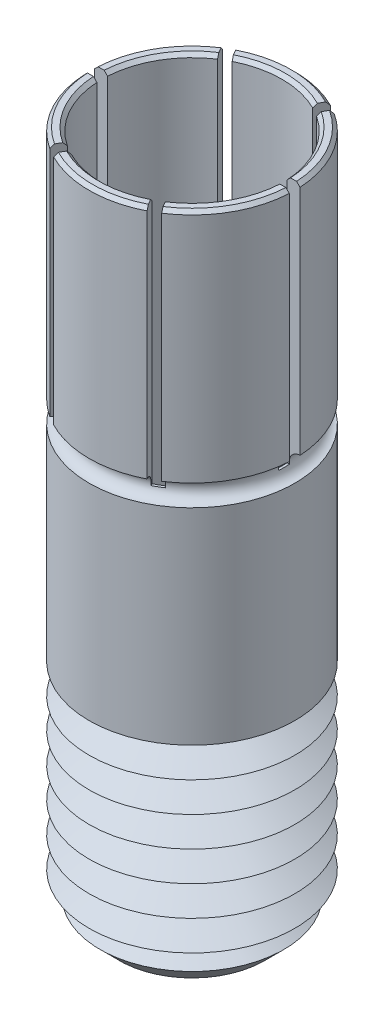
ISO-10303-21;
HEADER;
FILE_DESCRIPTION(('STEP AP214'),'2;1');
FILE_NAME('part.step','',(''),(''),'','','');
FILE_SCHEMA(('AUTOMOTIVE_DESIGN { 1 0 10303 214 1 1 1 1 }'));
ENDSEC;
DATA;
#1=APPLICATION_CONTEXT('core data for automotive mechanical design processes');
#2=APPLICATION_PROTOCOL_DEFINITION('international standard','automotive_design',2000,#1);
#3=PRODUCT_CONTEXT('',#1,'mechanical');
#4=PRODUCT('Part','Part','',(#3));
#5=PRODUCT_RELATED_PRODUCT_CATEGORY('part','',(#4));
#6=PRODUCT_DEFINITION_FORMATION('','',#4);
#7=PRODUCT_DEFINITION_CONTEXT('part definition',#1,'design');
#8=PRODUCT_DEFINITION('design','',#6,#7);
#9=PRODUCT_DEFINITION_SHAPE('','',#8);
#10=(LENGTH_UNIT() NAMED_UNIT(*) SI_UNIT(.MILLI.,.METRE.));
#11=(NAMED_UNIT(*) PLANE_ANGLE_UNIT() SI_UNIT($,.RADIAN.));
#12=(NAMED_UNIT(*) SI_UNIT($,.STERADIAN.) SOLID_ANGLE_UNIT());
#13=UNCERTAINTY_MEASURE_WITH_UNIT(LENGTH_MEASURE(1.E-05),#10,'distance_accuracy_value','');
#14=(GEOMETRIC_REPRESENTATION_CONTEXT(3) GLOBAL_UNCERTAINTY_ASSIGNED_CONTEXT((#13)) GLOBAL_UNIT_ASSIGNED_CONTEXT((#10,
#11,#12)) REPRESENTATION_CONTEXT('',''));
#15=CARTESIAN_POINT('',(0.,0.,0.));
#16=DIRECTION('',(0.,0.,1.));
#17=DIRECTION('',(1.,0.,0.));
#18=AXIS2_PLACEMENT_3D('',#15,#16,#17);
#19=CARTESIAN_POINT('',(0.,63.0319188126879,0.));
#20=DIRECTION('',(0.,1.,0.));
#21=DIRECTION('',(0.,0.,1.));
#22=AXIS2_PLACEMENT_3D('',#19,#20,#21);
#23=CYLINDRICAL_SURFACE('',#22,6.);
#24=CARTESIAN_POINT('',(0.,-13.1746931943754,0.));
#25=DIRECTION('',(0.,1.,0.));
#26=DIRECTION('',(0.,0.,1.));
#27=AXIS2_PLACEMENT_3D('',#24,#25,#26);
#28=CIRCLE('',#27,6.);
#29=CARTESIAN_POINT('',(0.,-13.1746931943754,6.));
#30=VERTEX_POINT('',#29);
#31=EDGE_CURVE('E832',#30,#30,#28,.T.);
#32=ORIENTED_EDGE('',*,*,#31,.F.);
#33=EDGE_LOOP('',(#32));
#34=FACE_BOUND('',#33,.T.);
#35=CARTESIAN_POINT('',(0.,-25.1746931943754,0.));
#36=DIRECTION('',(0.,1.,0.));
#37=DIRECTION('',(0.,0.,1.));
#38=AXIS2_PLACEMENT_3D('',#35,#36,#37);
#39=CIRCLE('',#38,6.);
#40=CARTESIAN_POINT('',(0.,-25.1746931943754,6.));
#41=VERTEX_POINT('',#40);
#42=EDGE_CURVE('E710',#41,#41,#39,.T.);
#43=ORIENTED_EDGE('',*,*,#42,.T.);
#44=EDGE_LOOP('',(#43));
#45=FACE_BOUND('',#44,.T.);
#46=ADVANCED_FACE('F35',(#34,#45),#23,.T.);
#47=CARTESIAN_POINT('',(0.,1.82530680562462,6.));
#48=DIRECTION('',(0.,1.,0.));
#49=DIRECTION('',(0.,0.,1.));
#50=AXIS2_PLACEMENT_3D('',#47,#48,#49);
#51=PLANE('',#50);
#52=DIRECTION('',(-0.50000000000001,0.,0.866025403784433));
#53=VECTOR('',#52,1.);
#54=CARTESIAN_POINT('',(-1.76247272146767,1.82530680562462,2.42769230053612));
#55=LINE('',#54,#53);
#56=CARTESIAN_POINT('',(-2.99114960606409,1.82530680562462,4.55582309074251));
#57=VERTEX_POINT('',#56);
#58=CARTESIAN_POINT('',(-3.16642055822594,1.82530680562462,4.85940128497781));
#59=VERTEX_POINT('',#58);
#60=EDGE_CURVE('E705',#57,#59,#55,.T.);
#61=ORIENTED_EDGE('',*,*,#60,.F.);
#62=CARTESIAN_POINT('',(0.,1.82530680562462,0.));
#63=DIRECTION('',(0.,1.,0.));
#64=DIRECTION('',(0.,0.,1.));
#65=AXIS2_PLACEMENT_3D('',#62,#63,#64);
#66=CIRCLE('',#65,5.45);
#67=CARTESIAN_POINT('',(-5.4410333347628,1.82530680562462,0.312500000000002));
#68=VERTEX_POINT('',#67);
#69=EDGE_CURVE('E339',#57,#68,#66,.F.);
#70=ORIENTED_EDGE('',*,*,#69,.T.);
#71=DIRECTION('',(1.,0.,0.));
#72=VECTOR('',#71,1.);
#73=CARTESIAN_POINT('',(-2.98367956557,1.82530680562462,0.312500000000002));
#74=LINE('',#73,#72);
#75=CARTESIAN_POINT('',(-5.79157523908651,1.82530680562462,0.312500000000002));
#76=VERTEX_POINT('',#75);
#77=EDGE_CURVE('E776',#76,#68,#74,.T.);
#78=ORIENTED_EDGE('',*,*,#77,.F.);
#79=CARTESIAN_POINT('',(0.,1.82530680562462,0.));
#80=DIRECTION('',(0.,1.,0.));
#81=DIRECTION('',(0.,0.,1.));
#82=AXIS2_PLACEMENT_3D('',#79,#80,#81);
#83=CIRCLE('',#82,5.79999999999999);
#84=EDGE_CURVE('E334',#76,#59,#83,.T.);
#85=ORIENTED_EDGE('',*,*,#84,.T.);
#86=EDGE_LOOP('',(#61,#70,#78,#85));
#87=FACE_BOUND('',#86,.T.);
#88=ADVANCED_FACE('F823',(#87),#51,.T.);
#89=DIRECTION('',(0.50000000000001,0.,-0.866025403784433));
#90=VECTOR('',#89,1.);
#91=CARTESIAN_POINT('',(-1.22120684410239,1.82530680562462,2.74019230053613));
#92=LINE('',#91,#90);
#93=CARTESIAN_POINT('',(-2.62515468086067,1.82530680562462,5.17190128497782));
#94=VERTEX_POINT('',#93);
#95=CARTESIAN_POINT('',(-2.44988372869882,1.82530680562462,4.86832309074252));
#96=VERTEX_POINT('',#95);
#97=EDGE_CURVE('E51',#94,#96,#92,.T.);
#98=ORIENTED_EDGE('',*,*,#97,.F.);
#99=CARTESIAN_POINT('',(2.62515468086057,1.82530680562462,5.17190128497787));
#100=VERTEX_POINT('',#99);
#101=EDGE_CURVE('E343',#94,#100,#83,.T.);
#102=ORIENTED_EDGE('',*,*,#101,.T.);
#103=DIRECTION('',(0.499999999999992,0.,0.866025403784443));
#104=VECTOR('',#103,1.);
#105=CARTESIAN_POINT('',(1.22120684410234,1.82530680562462,2.74019230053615));
#106=LINE('',#105,#104);
#107=CARTESIAN_POINT('',(2.44988372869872,1.82530680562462,4.86832309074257));
#108=VERTEX_POINT('',#107);
#109=EDGE_CURVE('E866',#108,#100,#106,.T.);
#110=ORIENTED_EDGE('',*,*,#109,.F.);
#111=EDGE_CURVE('E916',#108,#96,#66,.F.);
#112=ORIENTED_EDGE('',*,*,#111,.T.);
#113=EDGE_LOOP('',(#98,#102,#110,#112));
#114=FACE_BOUND('',#113,.T.);
#115=ADVANCED_FACE('F828',(#114),#51,.T.);
#116=DIRECTION('',(-0.499999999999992,0.,-0.866025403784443));
#117=VECTOR('',#116,1.);
#118=CARTESIAN_POINT('',(1.76247272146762,1.82530680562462,2.42769230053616));
#119=LINE('',#118,#117);
#120=CARTESIAN_POINT('',(3.16642055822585,1.82530680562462,4.85940128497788));
#121=VERTEX_POINT('',#120);
#122=CARTESIAN_POINT('',(2.991149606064,1.82530680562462,4.55582309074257));
#123=VERTEX_POINT('',#122);
#124=EDGE_CURVE('E59',#121,#123,#119,.T.);
#125=ORIENTED_EDGE('',*,*,#124,.F.);
#126=CARTESIAN_POINT('',(5.79157523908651,1.82530680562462,0.312499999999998));
#127=VERTEX_POINT('',#126);
#128=EDGE_CURVE('E351',#121,#127,#83,.T.);
#129=ORIENTED_EDGE('',*,*,#128,.T.);
#130=DIRECTION('',(1.,0.,0.));
#131=VECTOR('',#130,1.);
#132=CARTESIAN_POINT('',(2.98367956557,1.82530680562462,0.312499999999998));
#133=LINE('',#132,#131);
#134=CARTESIAN_POINT('',(5.4410333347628,1.82530680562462,0.312499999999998));
#135=VERTEX_POINT('',#134);
#136=EDGE_CURVE('E669',#135,#127,#133,.T.);
#137=ORIENTED_EDGE('',*,*,#136,.F.);
#138=EDGE_CURVE('E907',#135,#123,#66,.F.);
#139=ORIENTED_EDGE('',*,*,#138,.T.);
#140=EDGE_LOOP('',(#125,#129,#137,#139));
#141=FACE_BOUND('',#140,.T.);
#142=ADVANCED_FACE('F1281',(#141),#51,.T.);
#143=DIRECTION('',(-1.,0.,0.));
#144=VECTOR('',#143,1.);
#145=CARTESIAN_POINT('',(2.98367956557,1.82530680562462,-0.312500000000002));
#146=LINE('',#145,#144);
#147=CARTESIAN_POINT('',(5.79157523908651,1.82530680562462,-0.312500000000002));
#148=VERTEX_POINT('',#147);
#149=CARTESIAN_POINT('',(5.4410333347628,1.82530680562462,-0.312500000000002));
#150=VERTEX_POINT('',#149);
#151=EDGE_CURVE('E368',#148,#150,#146,.T.);
#152=ORIENTED_EDGE('',*,*,#151,.F.);
#153=CARTESIAN_POINT('',(3.16642055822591,1.82530680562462,-4.85940128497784));
#154=VERTEX_POINT('',#153);
#155=EDGE_CURVE('E336',#148,#154,#83,.T.);
#156=ORIENTED_EDGE('',*,*,#155,.T.);
#157=DIRECTION('',(0.500000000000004,0.,-0.866025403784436));
#158=VECTOR('',#157,1.);
#159=CARTESIAN_POINT('',(1.76247272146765,1.82530680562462,-2.42769230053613));
#160=LINE('',#159,#158);
#161=CARTESIAN_POINT('',(2.99114960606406,1.82530680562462,-4.55582309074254));
#162=VERTEX_POINT('',#161);
#163=EDGE_CURVE('E366',#162,#154,#160,.T.);
#164=ORIENTED_EDGE('',*,*,#163,.F.);
#165=EDGE_CURVE('E918',#162,#150,#66,.F.);
#166=ORIENTED_EDGE('',*,*,#165,.T.);
#167=EDGE_LOOP('',(#152,#156,#164,#166));
#168=FACE_BOUND('',#167,.T.);
#169=ADVANCED_FACE('F364',(#168),#51,.T.);
#170=DIRECTION('',(-0.500000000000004,0.,0.866025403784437));
#171=VECTOR('',#170,1.);
#172=CARTESIAN_POINT('',(1.22120684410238,1.82530680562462,-2.74019230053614));
#173=LINE('',#172,#171);
#174=CARTESIAN_POINT('',(2.62515468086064,1.82530680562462,-5.17190128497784));
#175=VERTEX_POINT('',#174);
#176=CARTESIAN_POINT('',(2.44988372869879,1.82530680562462,-4.86832309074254));
#177=VERTEX_POINT('',#176);
#178=EDGE_CURVE('E850',#175,#177,#173,.T.);
#179=ORIENTED_EDGE('',*,*,#178,.F.);
#180=CARTESIAN_POINT('',(-2.62515468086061,1.82530680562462,-5.17190128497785));
#181=VERTEX_POINT('',#180);
#182=EDGE_CURVE('E332',#175,#181,#83,.T.);
#183=ORIENTED_EDGE('',*,*,#182,.T.);
#184=DIRECTION('',(-0.499999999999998,0.,-0.86602540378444));
#185=VECTOR('',#184,1.);
#186=CARTESIAN_POINT('',(-1.22120684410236,1.82530680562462,-2.74019230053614));
#187=LINE('',#186,#185);
#188=CARTESIAN_POINT('',(-2.44988372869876,1.82530680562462,-4.86832309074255));
#189=VERTEX_POINT('',#188);
#190=EDGE_CURVE('E326',#189,#181,#187,.T.);
#191=ORIENTED_EDGE('',*,*,#190,.F.);
#192=EDGE_CURVE('E337',#189,#177,#66,.F.);
#193=ORIENTED_EDGE('',*,*,#192,.T.);
#194=EDGE_LOOP('',(#179,#183,#191,#193));
#195=FACE_BOUND('',#194,.T.);
#196=ADVANCED_FACE('F987',(#195),#51,.T.);
#197=CARTESIAN_POINT('',(0.,63.0319188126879,0.));
#198=DIRECTION('',(0.,1.,0.));
#199=DIRECTION('',(0.,0.,1.));
#200=AXIS2_PLACEMENT_3D('',#197,#198,#199);
#201=CYLINDRICAL_SURFACE('',#200,6.);
#202=DIRECTION('',(0.,1.,0.));
#203=VECTOR('',#202,1.);
#204=CARTESIAN_POINT('',(-3.2665611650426,-12.6746931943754,5.03284990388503));
#205=LINE('',#204,#203);
#206=CARTESIAN_POINT('',(-3.2665611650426,-11.9246931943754,5.03284990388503));
#207=VERTEX_POINT('',#206);
#208=CARTESIAN_POINT('',(-3.2665611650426,1.62530680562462,5.03284990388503));
#209=VERTEX_POINT('',#208);
#210=EDGE_CURVE('E703',#207,#209,#205,.T.);
#211=ORIENTED_EDGE('',*,*,#210,.T.);
#212=CARTESIAN_POINT('',(0.,1.62530680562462,0.));
#213=DIRECTION('',(0.,1.,0.));
#214=DIRECTION('',(0.,0.,1.));
#215=AXIS2_PLACEMENT_3D('',#212,#213,#214);
#216=CIRCLE('',#215,6.);
#217=CARTESIAN_POINT('',(-5.99185645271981,1.62530680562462,0.312500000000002));
#218=VERTEX_POINT('',#217);
#219=EDGE_CURVE('E342',#209,#218,#216,.F.);
#220=ORIENTED_EDGE('',*,*,#219,.T.);
#221=DIRECTION('',(0.,1.,0.));
#222=VECTOR('',#221,1.);
#223=CARTESIAN_POINT('',(-5.99185645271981,-12.6746931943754,0.312500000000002));
#224=LINE('',#223,#222);
#225=CARTESIAN_POINT('',(-5.99185645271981,-11.9246931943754,0.312500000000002));
#226=VERTEX_POINT('',#225);
#227=EDGE_CURVE('E768',#226,#218,#224,.T.);
#228=ORIENTED_EDGE('',*,*,#227,.F.);
#229=CARTESIAN_POINT('',(0.,-11.9246931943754,0.));
#230=DIRECTION('',(0.,1.,0.));
#231=DIRECTION('',(0.,0.,1.));
#232=AXIS2_PLACEMENT_3D('',#229,#230,#231);
#233=CIRCLE('',#232,6.);
#234=EDGE_CURVE('E807',#226,#207,#233,.T.);
#235=ORIENTED_EDGE('',*,*,#234,.T.);
#236=EDGE_LOOP('',(#211,#220,#228,#235));
#237=FACE_BOUND('',#236,.T.);
#238=ADVANCED_FACE('F805',(#237),#201,.T.);
#239=DIRECTION('',(0.,1.,0.));
#240=VECTOR('',#239,1.);
#241=CARTESIAN_POINT('',(-2.72529528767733,-12.6746931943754,5.34534990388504));
#242=LINE('',#241,#240);
#243=CARTESIAN_POINT('',(-2.72529528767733,-11.9246931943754,5.34534990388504));
#244=VERTEX_POINT('',#243);
#245=CARTESIAN_POINT('',(-2.72529528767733,1.62530680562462,5.34534990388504));
#246=VERTEX_POINT('',#245);
#247=EDGE_CURVE('E701',#244,#246,#242,.T.);
#248=ORIENTED_EDGE('',*,*,#247,.F.);
#249=CARTESIAN_POINT('',(2.72529528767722,-11.9246931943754,5.34534990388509));
#250=VERTEX_POINT('',#249);
#251=EDGE_CURVE('E921',#244,#250,#233,.T.);
#252=ORIENTED_EDGE('',*,*,#251,.T.);
#253=DIRECTION('',(0.,1.,0.));
#254=VECTOR('',#253,1.);
#255=CARTESIAN_POINT('',(2.72529528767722,-12.6746931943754,5.34534990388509));
#256=LINE('',#255,#254);
#257=CARTESIAN_POINT('',(2.72529528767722,1.62530680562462,5.34534990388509));
#258=VERTEX_POINT('',#257);
#259=EDGE_CURVE('E859',#250,#258,#256,.T.);
#260=ORIENTED_EDGE('',*,*,#259,.T.);
#261=EDGE_CURVE('E348',#258,#246,#216,.F.);
#262=ORIENTED_EDGE('',*,*,#261,.T.);
#263=EDGE_LOOP('',(#248,#252,#260,#262));
#264=FACE_BOUND('',#263,.T.);
#265=ADVANCED_FACE('F948',(#264),#201,.T.);
#266=DIRECTION('',(0.,1.,0.));
#267=VECTOR('',#266,1.);
#268=CARTESIAN_POINT('',(3.2665611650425,-12.6746931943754,5.0328499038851));
#269=LINE('',#268,#267);
#270=CARTESIAN_POINT('',(3.2665611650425,-11.9246931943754,5.0328499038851));
#271=VERTEX_POINT('',#270);
#272=CARTESIAN_POINT('',(3.2665611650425,1.62530680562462,5.0328499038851));
#273=VERTEX_POINT('',#272);
#274=EDGE_CURVE('E869',#271,#273,#269,.T.);
#275=ORIENTED_EDGE('',*,*,#274,.F.);
#276=CARTESIAN_POINT('',(5.99185645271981,-11.9246931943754,0.312499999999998));
#277=VERTEX_POINT('',#276);
#278=EDGE_CURVE('E951',#271,#277,#233,.T.);
#279=ORIENTED_EDGE('',*,*,#278,.T.);
#280=DIRECTION('',(0.,1.,0.));
#281=VECTOR('',#280,1.);
#282=CARTESIAN_POINT('',(5.99185645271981,-12.6746931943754,0.312499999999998));
#283=LINE('',#282,#281);
#284=CARTESIAN_POINT('',(5.99185645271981,1.62530680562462,0.312499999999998));
#285=VERTEX_POINT('',#284);
#286=EDGE_CURVE('E852',#277,#285,#283,.T.);
#287=ORIENTED_EDGE('',*,*,#286,.T.);
#288=EDGE_CURVE('E882',#285,#273,#216,.F.);
#289=ORIENTED_EDGE('',*,*,#288,.T.);
#290=EDGE_LOOP('',(#275,#279,#287,#289));
#291=FACE_BOUND('',#290,.T.);
#292=ADVANCED_FACE('F883',(#291),#201,.T.);
#293=DIRECTION('',(0.,1.,0.));
#294=VECTOR('',#293,1.);
#295=CARTESIAN_POINT('',(5.99185645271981,-12.6746931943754,-0.312500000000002));
#296=LINE('',#295,#294);
#297=CARTESIAN_POINT('',(5.99185645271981,-11.9246931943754,-0.312500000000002));
#298=VERTEX_POINT('',#297);
#299=CARTESIAN_POINT('',(5.99185645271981,1.62530680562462,-0.312500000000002));
#300=VERTEX_POINT('',#299);
#301=EDGE_CURVE('E857',#298,#300,#296,.T.);
#302=ORIENTED_EDGE('',*,*,#301,.F.);
#303=CARTESIAN_POINT('',(3.26656116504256,-11.9246931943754,-5.03284990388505));
#304=VERTEX_POINT('',#303);
#305=EDGE_CURVE('E952',#298,#304,#233,.T.);
#306=ORIENTED_EDGE('',*,*,#305,.T.);
#307=DIRECTION('',(0.,1.,0.));
#308=VECTOR('',#307,1.);
#309=CARTESIAN_POINT('',(3.26656116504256,-12.6746931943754,-5.03284990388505));
#310=LINE('',#309,#308);
#311=CARTESIAN_POINT('',(3.26656116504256,1.62530680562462,-5.03284990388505));
#312=VERTEX_POINT('',#311);
#313=EDGE_CURVE('E327',#304,#312,#310,.T.);
#314=ORIENTED_EDGE('',*,*,#313,.T.);
#315=EDGE_CURVE('E377',#312,#300,#216,.F.);
#316=ORIENTED_EDGE('',*,*,#315,.T.);
#317=EDGE_LOOP('',(#302,#306,#314,#316));
#318=FACE_BOUND('',#317,.T.);
#319=ADVANCED_FACE('F818',(#318),#201,.T.);
#320=DIRECTION('',(0.,1.,0.));
#321=VECTOR('',#320,1.);
#322=CARTESIAN_POINT('',(2.72529528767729,-12.6746931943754,-5.34534990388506));
#323=LINE('',#322,#321);
#324=CARTESIAN_POINT('',(2.72529528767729,-11.9246931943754,-5.34534990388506));
#325=VERTEX_POINT('',#324);
#326=CARTESIAN_POINT('',(2.72529528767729,1.62530680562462,-5.34534990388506));
#327=VERTEX_POINT('',#326);
#328=EDGE_CURVE('E849',#325,#327,#323,.T.);
#329=ORIENTED_EDGE('',*,*,#328,.F.);
#330=CARTESIAN_POINT('',(-2.72529528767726,-11.9246931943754,-5.34534990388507));
#331=VERTEX_POINT('',#330);
#332=EDGE_CURVE('E954',#325,#331,#233,.T.);
#333=ORIENTED_EDGE('',*,*,#332,.T.);
#334=DIRECTION('',(0.,1.,0.));
#335=VECTOR('',#334,1.);
#336=CARTESIAN_POINT('',(-2.72529528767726,-12.6746931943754,-5.34534990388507));
#337=LINE('',#336,#335);
#338=CARTESIAN_POINT('',(-2.72529528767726,1.62530680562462,-5.34534990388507));
#339=VERTEX_POINT('',#338);
#340=EDGE_CURVE('E721',#331,#339,#337,.T.);
#341=ORIENTED_EDGE('',*,*,#340,.T.);
#342=EDGE_CURVE('E884',#339,#327,#216,.F.);
#343=ORIENTED_EDGE('',*,*,#342,.T.);
#344=EDGE_LOOP('',(#329,#333,#341,#343));
#345=FACE_BOUND('',#344,.T.);
#346=ADVANCED_FACE('F811',(#345),#201,.T.);
#347=CARTESIAN_POINT('',(0.,1.82530680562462,0.));
#348=DIRECTION('',(0.,-1.,0.));
#349=DIRECTION('',(0.,0.,-1.));
#350=AXIS2_PLACEMENT_3D('',#347,#348,#349);
#351=CONICAL_SURFACE('',#350,5.8,0.785398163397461);
#352=CARTESIAN_POINT('',(-3.16632041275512,1.82550680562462,4.8592278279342));
#353=CARTESIAN_POINT('',(-3.18304429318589,1.79210760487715,4.88819443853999));
#354=CARTESIAN_POINT('',(-3.19976797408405,1.75870800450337,4.91716070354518));
#355=CARTESIAN_POINT('',(-3.23321493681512,1.69190800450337,4.97509254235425));
#356=CARTESIAN_POINT('',(-3.24993821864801,1.65850760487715,5.00405811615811));
#357=CARTESIAN_POINT('',(-3.26666130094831,1.62510680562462,5.03302334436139));
#358=B_SPLINE_CURVE_WITH_KNOTS('',3,(#352,#353,#354,#355,#356,#357),.UNSPECIFIED.,.F.,.F.,(4,2,
4),(0.,0.141803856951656,0.283607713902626),.UNSPECIFIED.);
#359=EDGE_CURVE('E796',#59,#209,#358,.T.);
#360=ORIENTED_EDGE('',*,*,#359,.F.);
#361=ORIENTED_EDGE('',*,*,#84,.F.);
#362=CARTESIAN_POINT('',(-9.60750255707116,-1.98727669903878,0.312500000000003));
#363=CARTESIAN_POINT('',(-9.28639752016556,-1.66634264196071,0.312500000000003));
#364=CARTESIAN_POINT('',(-8.96528515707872,-1.34541591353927,0.312500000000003));
#365=CARTESIAN_POINT('',(-8.32303685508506,-0.703586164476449,0.312500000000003));
#366=CARTESIAN_POINT('',(-8.00190091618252,-0.382683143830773,0.312500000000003));
#367=CARTESIAN_POINT('',(-7.35959668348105,0.259089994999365,0.312500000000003));
#368=CARTESIAN_POINT('',(-7.0384283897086,0.579960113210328,0.312500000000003));
#369=CARTESIAN_POINT('',(-6.39604309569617,1.22165171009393,0.312500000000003));
#370=CARTESIAN_POINT('',(-6.07482609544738,1.54247318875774,0.312500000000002));
#371=CARTESIAN_POINT('',(-5.43231439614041,2.1840392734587,0.312500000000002));
#372=CARTESIAN_POINT('',(-5.11101969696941,2.50478387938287,0.312500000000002));
#373=CARTESIAN_POINT('',(-4.46830021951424,3.14614249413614,0.312500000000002));
#374=CARTESIAN_POINT('',(-4.14687544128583,3.46675650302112,0.312500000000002));
#375=CARTESIAN_POINT('',(-3.66454511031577,3.94748429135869,0.312500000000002));
#376=CARTESIAN_POINT('',(-3.50373600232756,4.10769481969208,0.312500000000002));
#377=CARTESIAN_POINT('',(-3.1820177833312,4.42801531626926,0.312500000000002));
#378=CARTESIAN_POINT('',(-3.02110867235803,4.5881252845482,0.312500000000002));
#379=CARTESIAN_POINT('',(-2.69914117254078,4.90819573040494,0.312500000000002));
#380=CARTESIAN_POINT('',(-2.53808278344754,5.06815620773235,0.312500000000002));
#381=CARTESIAN_POINT('',(-2.21567788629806,5.38778687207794,0.312500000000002));
#382=CARTESIAN_POINT('',(-2.05433137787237,5.54745705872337,0.312500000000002));
#383=CARTESIAN_POINT('',(-1.8927714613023,5.70691162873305,0.312500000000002));
#384=B_SPLINE_CURVE_WITH_KNOTS('',3,(#362,#363,#364,#365,#366,#367,#368,#369,#370,#371,#372,
#373,#374,#375,#376,#377,#378,#379,#380,#381,#382,#383),.UNSPECIFIED.,.F.,.F.,(4,2,2,2,2,2,2,2,
2,2,4),(0.,1.36197064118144,2.7239410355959,4.08591032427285,5.44787985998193,6.80985138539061,
8.17182232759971,8.852808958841,9.53379535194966,10.2147828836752,10.8957712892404),.UNSPECIFIED.);
#385=EDGE_CURVE('E753',#218,#76,#384,.T.);
#386=ORIENTED_EDGE('',*,*,#385,.F.);
#387=ORIENTED_EDGE('',*,*,#219,.F.);
#388=EDGE_LOOP('',(#360,#361,#386,#387));
#389=FACE_BOUND('',#388,.T.);
#390=ADVANCED_FACE('F808',(#389),#351,.T.);
#391=CARTESIAN_POINT('',(-2.72539542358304,1.62510680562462,5.34552334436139));
#392=CARTESIAN_POINT('',(-2.70867234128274,1.65850760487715,5.31655811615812));
#393=CARTESIAN_POINT('',(-2.69194905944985,1.69190800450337,5.28759254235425));
#394=CARTESIAN_POINT('',(-2.65850209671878,1.75870800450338,5.22966070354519));
#395=CARTESIAN_POINT('',(-2.64177841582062,1.79210760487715,5.20069443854));
#396=CARTESIAN_POINT('',(-2.62505453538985,1.82550680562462,5.17172782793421));
#397=B_SPLINE_CURVE_WITH_KNOTS('',3,(#391,#392,#393,#394,#395,#396),.UNSPECIFIED.,.F.,.F.,(4,2,
4),(0.,0.141803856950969,0.283607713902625),.UNSPECIFIED.);
#398=EDGE_CURVE('E516',#246,#94,#397,.T.);
#399=ORIENTED_EDGE('',*,*,#398,.F.);
#400=ORIENTED_EDGE('',*,*,#261,.F.);
#401=CARTESIAN_POINT('',(2.62505453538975,1.82550680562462,5.17172782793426));
#402=CARTESIAN_POINT('',(2.64177841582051,1.79210760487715,5.20069443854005));
#403=CARTESIAN_POINT('',(2.65850209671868,1.75870800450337,5.22966070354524));
#404=CARTESIAN_POINT('',(2.69194905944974,1.69190800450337,5.28759254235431));
#405=CARTESIAN_POINT('',(2.70867234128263,1.65850760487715,5.31655811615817));
#406=CARTESIAN_POINT('',(2.72539542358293,1.62510680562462,5.34552334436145));
#407=B_SPLINE_CURVE_WITH_KNOTS('',3,(#401,#402,#403,#404,#405,#406),.UNSPECIFIED.,.F.,.F.,(4,2,
4),(0.,0.141803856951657,0.283607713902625),.UNSPECIFIED.);
#408=EDGE_CURVE('E603',#100,#258,#407,.T.);
#409=ORIENTED_EDGE('',*,*,#408,.F.);
#410=ORIENTED_EDGE('',*,*,#101,.F.);
#411=EDGE_LOOP('',(#399,#400,#409,#410));
#412=FACE_BOUND('',#411,.T.);
#413=ADVANCED_FACE('F810',(#412),#351,.T.);
#414=CARTESIAN_POINT('',(3.26666130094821,1.62510680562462,5.03302334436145));
#415=CARTESIAN_POINT('',(3.24993821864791,1.65850760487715,5.00405811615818));
#416=CARTESIAN_POINT('',(3.23321493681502,1.69190800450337,4.97509254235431));
#417=CARTESIAN_POINT('',(3.19976797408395,1.75870800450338,4.91716070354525));
#418=CARTESIAN_POINT('',(3.18304429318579,1.79210760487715,4.88819443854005));
#419=CARTESIAN_POINT('',(3.16632041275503,1.82550680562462,4.85922782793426));
#420=B_SPLINE_CURVE_WITH_KNOTS('',3,(#414,#415,#416,#417,#418,#419),.UNSPECIFIED.,.F.,.F.,(4,2,
4),(0.,0.141803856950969,0.283607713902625),.UNSPECIFIED.);
#421=EDGE_CURVE('E621',#273,#121,#420,.T.);
#422=ORIENTED_EDGE('',*,*,#421,.F.);
#423=ORIENTED_EDGE('',*,*,#288,.F.);
#424=CARTESIAN_POINT('',(1.8927714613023,5.70691162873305,0.312499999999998));
#425=CARTESIAN_POINT('',(2.02608377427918,5.57535254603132,0.312499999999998));
#426=CARTESIAN_POINT('',(2.15924140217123,5.44363709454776,0.312499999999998));
#427=CARTESIAN_POINT('',(2.42534071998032,5.17998848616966,0.312499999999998));
#428=CARTESIAN_POINT('',(2.5582824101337,5.04805532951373,0.312499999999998));
#429=CARTESIAN_POINT('',(2.95692374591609,4.65207182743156,0.312499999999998));
#430=CARTESIAN_POINT('',(3.22244007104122,4.38783703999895,0.312499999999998));
#431=CARTESIAN_POINT('',(3.86576096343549,3.74708106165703,0.312499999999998));
#432=CARTESIAN_POINT('',(4.24345096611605,3.3704449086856,0.312499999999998));
#433=CARTESIAN_POINT('',(4.99863425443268,2.61697464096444,0.312499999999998));
#434=CARTESIAN_POINT('',(5.37612753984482,2.24014052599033,0.312499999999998));
#435=CARTESIAN_POINT('',(6.39608515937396,1.22169189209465,0.312499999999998));
#436=CARTESIAN_POINT('',(7.03845395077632,0.579981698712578,0.312499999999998));
#437=CARTESIAN_POINT('',(8.32304803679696,-0.703579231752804,0.312499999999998));
#438=CARTESIAN_POINT('',(8.96527333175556,-1.34542996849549,0.312499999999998));
#439=CARTESIAN_POINT('',(9.60750255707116,-1.98727669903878,0.312499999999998));
#440=B_SPLINE_CURVE_WITH_KNOTS('',3,(#424,#425,#426,#427,#428,#429,#430,#431,#432,#433,#434,
#435,#436,#437,#438,#439),.UNSPECIFIED.,.F.,.F.,(4,2,2,2,2,2,2,4),(0.,0.561888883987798,
1.12377715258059,2.24755194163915,3.84772076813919,5.44789141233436,8.17183460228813,
10.8957712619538),.UNSPECIFIED.);
#441=EDGE_CURVE('E629',#127,#285,#440,.T.);
#442=ORIENTED_EDGE('',*,*,#441,.F.);
#443=ORIENTED_EDGE('',*,*,#128,.F.);
#444=EDGE_LOOP('',(#422,#423,#442,#443));
#445=FACE_BOUND('',#444,.T.);
#446=ADVANCED_FACE('F816',(#445),#351,.T.);
#447=CARTESIAN_POINT('',(9.60750255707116,-1.98727669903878,-0.312500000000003));
#448=CARTESIAN_POINT('',(9.28639752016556,-1.66634264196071,-0.312500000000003));
#449=CARTESIAN_POINT('',(8.96528515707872,-1.34541591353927,-0.312500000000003));
#450=CARTESIAN_POINT('',(8.32303685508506,-0.703586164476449,-0.312500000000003));
#451=CARTESIAN_POINT('',(8.00190091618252,-0.382683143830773,-0.312500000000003));
#452=CARTESIAN_POINT('',(7.35959668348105,0.259089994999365,-0.312500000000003));
#453=CARTESIAN_POINT('',(7.0384283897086,0.579960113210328,-0.312500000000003));
#454=CARTESIAN_POINT('',(6.39604309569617,1.22165171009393,-0.312500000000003));
#455=CARTESIAN_POINT('',(6.07482609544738,1.54247318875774,-0.312500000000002));
#456=CARTESIAN_POINT('',(5.43231439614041,2.1840392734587,-0.312500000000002));
#457=CARTESIAN_POINT('',(5.11101969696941,2.50478387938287,-0.312500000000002));
#458=CARTESIAN_POINT('',(4.46830021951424,3.14614249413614,-0.312500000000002));
#459=CARTESIAN_POINT('',(4.14687544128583,3.46675650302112,-0.312500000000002));
#460=CARTESIAN_POINT('',(3.66454511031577,3.94748429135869,-0.312500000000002));
#461=CARTESIAN_POINT('',(3.50373600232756,4.10769481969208,-0.312500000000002));
#462=CARTESIAN_POINT('',(3.1820177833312,4.42801531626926,-0.312500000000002));
#463=CARTESIAN_POINT('',(3.02110867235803,4.5881252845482,-0.312500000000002));
#464=CARTESIAN_POINT('',(2.69914117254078,4.90819573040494,-0.312500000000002));
#465=CARTESIAN_POINT('',(2.53808278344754,5.06815620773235,-0.312500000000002));
#466=CARTESIAN_POINT('',(2.21567788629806,5.38778687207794,-0.312500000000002));
#467=CARTESIAN_POINT('',(2.05433137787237,5.54745705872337,-0.312500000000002));
#468=CARTESIAN_POINT('',(1.8927714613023,5.70691162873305,-0.312500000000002));
#469=B_SPLINE_CURVE_WITH_KNOTS('',3,(#447,#448,#449,#450,#451,#452,#453,#454,#455,#456,#457,
#458,#459,#460,#461,#462,#463,#464,#465,#466,#467,#468),.UNSPECIFIED.,.F.,.F.,(4,2,2,2,2,2,2,2,
2,2,4),(0.,1.36197064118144,2.7239410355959,4.08591032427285,5.44787985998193,6.80985138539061,
8.17182232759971,8.852808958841,9.53379535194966,10.2147828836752,10.8957712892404),.UNSPECIFIED.);
#470=EDGE_CURVE('E374',#300,#148,#469,.T.);
#471=ORIENTED_EDGE('',*,*,#470,.F.);
#472=ORIENTED_EDGE('',*,*,#315,.F.);
#473=CARTESIAN_POINT('',(3.16632041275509,1.82550680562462,-4.85922782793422));
#474=CARTESIAN_POINT('',(3.18304429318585,1.79210760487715,-4.88819443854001));
#475=CARTESIAN_POINT('',(3.19976797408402,1.75870800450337,-4.91716070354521));
#476=CARTESIAN_POINT('',(3.23321493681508,1.69190800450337,-4.97509254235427));
#477=CARTESIAN_POINT('',(3.24993821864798,1.65850760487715,-5.00405811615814));
#478=CARTESIAN_POINT('',(3.26666130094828,1.62510680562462,-5.03302334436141));
#479=B_SPLINE_CURVE_WITH_KNOTS('',3,(#473,#474,#475,#476,#477,#478),.UNSPECIFIED.,.F.,.F.,(4,2,
4),(0.,0.141803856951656,0.283607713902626),.UNSPECIFIED.);
#480=EDGE_CURVE('E376',#154,#312,#479,.T.);
#481=ORIENTED_EDGE('',*,*,#480,.F.);
#482=ORIENTED_EDGE('',*,*,#155,.F.);
#483=EDGE_LOOP('',(#471,#472,#481,#482));
#484=FACE_BOUND('',#483,.T.);
#485=ADVANCED_FACE('F372',(#484),#351,.T.);
#486=CARTESIAN_POINT('',(2.725395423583,1.62510680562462,-5.34552334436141));
#487=CARTESIAN_POINT('',(2.7086723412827,1.65850760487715,-5.31655811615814));
#488=CARTESIAN_POINT('',(2.69194905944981,1.69190800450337,-5.28759254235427));
#489=CARTESIAN_POINT('',(2.65850209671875,1.75870800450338,-5.22966070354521));
#490=CARTESIAN_POINT('',(2.64177841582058,1.79210760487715,-5.20069443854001));
#491=CARTESIAN_POINT('',(2.62505453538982,1.82550680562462,-5.17172782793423));
#492=B_SPLINE_CURVE_WITH_KNOTS('',3,(#486,#487,#488,#489,#490,#491),.UNSPECIFIED.,.F.,.F.,(4,2,
4),(0.,0.141803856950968,0.283607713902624),.UNSPECIFIED.);
#493=EDGE_CURVE('E972',#327,#175,#492,.T.);
#494=ORIENTED_EDGE('',*,*,#493,.F.);
#495=ORIENTED_EDGE('',*,*,#342,.F.);
#496=CARTESIAN_POINT('',(-2.62505453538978,1.82550680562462,-5.17172782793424));
#497=CARTESIAN_POINT('',(-2.64177841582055,1.79210760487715,-5.20069443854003));
#498=CARTESIAN_POINT('',(-2.65850209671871,1.75870800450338,-5.22966070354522));
#499=CARTESIAN_POINT('',(-2.69194905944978,1.69190800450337,-5.28759254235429));
#500=CARTESIAN_POINT('',(-2.70867234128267,1.65850760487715,-5.31655811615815));
#501=CARTESIAN_POINT('',(-2.72539542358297,1.62510680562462,-5.34552334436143));
#502=B_SPLINE_CURVE_WITH_KNOTS('',3,(#496,#497,#498,#499,#500,#501),.UNSPECIFIED.,.F.,.F.,(4,2,
4),(0.,0.141803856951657,0.283607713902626),.UNSPECIFIED.);
#503=EDGE_CURVE('E964',#181,#339,#502,.T.);
#504=ORIENTED_EDGE('',*,*,#503,.F.);
#505=ORIENTED_EDGE('',*,*,#182,.F.);
#506=EDGE_LOOP('',(#494,#495,#504,#505));
#507=FACE_BOUND('',#506,.T.);
#508=ADVANCED_FACE('F821',(#507),#351,.T.);
#509=CARTESIAN_POINT('',(0.,1.62530680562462,0.));
#510=DIRECTION('',(0.,1.,0.));
#511=DIRECTION('',(0.,0.,1.));
#512=AXIS2_PLACEMENT_3D('',#509,#510,#511);
#513=CONICAL_SURFACE('',#512,5.25,0.785398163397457);
#514=CARTESIAN_POINT('',(-2.8908783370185,1.62510680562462,4.38214815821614));
#515=CARTESIAN_POINT('',(-2.9076074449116,1.65850573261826,4.4111238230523));
#516=CARTESIAN_POINT('',(-2.92433628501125,1.69190519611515,4.44009902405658));
#517=CARTESIAN_POINT('',(-2.95779342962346,1.75870519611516,4.49804849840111));
#518=CARTESIAN_POINT('',(-2.97452173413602,1.79210573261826,4.52702277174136));
#519=CARTESIAN_POINT('',(-2.99124977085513,1.82550680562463,4.55599658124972));
#520=B_SPLINE_CURVE_WITH_KNOTS('',3,(#514,#515,#516,#517,#518,#519),.UNSPECIFIED.,.F.,.F.,(4,2,
4),(0.,0.141825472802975,0.283650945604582),.UNSPECIFIED.);
#521=CARTESIAN_POINT('',(-2.89097851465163,1.62530680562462,4.3823216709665));
#522=VERTEX_POINT('',#521);
#523=EDGE_CURVE('E498',#522,#57,#520,.T.);
#524=ORIENTED_EDGE('',*,*,#523,.F.);
#525=CARTESIAN_POINT('',(0.,1.62530680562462,0.));
#526=DIRECTION('',(0.,1.,0.));
#527=DIRECTION('',(0.,0.,1.));
#528=AXIS2_PLACEMENT_3D('',#525,#526,#527);
#529=CIRCLE('',#528,5.25);
#530=CARTESIAN_POINT('',(-5.24069115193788,1.62530680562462,0.312500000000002));
#531=VERTEX_POINT('',#530);
#532=EDGE_CURVE('E887',#531,#522,#529,.T.);
#533=ORIENTED_EDGE('',*,*,#532,.F.);
#534=CARTESIAN_POINT('',(-8.41052938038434,4.79163977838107,0.312500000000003));
#535=CARTESIAN_POINT('',(-7.88238536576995,4.26389405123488,0.312500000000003));
#536=CARTESIAN_POINT('',(-7.35423742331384,3.73615218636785,0.312500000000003));
#537=CARTESIAN_POINT('',(-6.29780654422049,2.68080436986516,0.312500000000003));
#538=CARTESIAN_POINT('',(-5.76952360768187,2.15319841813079,0.312500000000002));
#539=CARTESIAN_POINT('',(-4.97690168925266,1.36198665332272,0.312500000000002));
#540=CARTESIAN_POINT('',(-4.7126612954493,1.09828209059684,0.312500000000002));
#541=CARTESIAN_POINT('',(-4.18406740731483,0.570986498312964,0.312500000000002));
#542=CARTESIAN_POINT('',(-3.91971391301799,0.307395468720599,0.312500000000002));
#543=CARTESIAN_POINT('',(-3.39081016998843,-0.219589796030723,0.312500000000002));
#544=CARTESIAN_POINT('',(-3.12625992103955,-0.482984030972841,0.312500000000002));
#545=CARTESIAN_POINT('',(-2.72912928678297,-0.877768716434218,0.312500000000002));
#546=CARTESIAN_POINT('',(-2.59670146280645,-1.00931256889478,0.312500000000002));
#547=CARTESIAN_POINT('',(-2.3316734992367,-1.27222672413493,0.312500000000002));
#548=CARTESIAN_POINT('',(-2.19907335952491,-1.40359702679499,0.312500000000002));
#549=CARTESIAN_POINT('',(-2.06635184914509,-1.53484482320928,0.312500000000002));
#550=B_SPLINE_CURVE_WITH_KNOTS('',3,(#534,#535,#536,#537,#538,#539,#540,#541,#542,#543,#544,
#545,#546,#547,#548,#549),.UNSPECIFIED.,.F.,.F.,(4,2,2,2,2,2,2,4),(0.,2.23988063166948,
4.47975963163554,5.59970056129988,6.71964115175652,7.83958297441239,8.39955446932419,
8.95952634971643),.UNSPECIFIED.);
#551=EDGE_CURVE('E441',#68,#531,#550,.T.);
#552=ORIENTED_EDGE('',*,*,#551,.F.);
#553=ORIENTED_EDGE('',*,*,#69,.F.);
#554=EDGE_LOOP('',(#524,#533,#552,#553));
#555=FACE_BOUND('',#554,.T.);
#556=ADVANCED_FACE('F436',(#555),#513,.F.);
#557=CARTESIAN_POINT('',(-2.44998389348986,1.82550680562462,4.86849658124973));
#558=CARTESIAN_POINT('',(-2.43325585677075,1.79210573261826,4.83952277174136));
#559=CARTESIAN_POINT('',(-2.41652755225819,1.75870519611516,4.81054849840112));
#560=CARTESIAN_POINT('',(-2.38307040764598,1.69190519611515,4.75259902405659));
#561=CARTESIAN_POINT('',(-2.36634156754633,1.65850573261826,4.72362382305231));
#562=CARTESIAN_POINT('',(-2.34961245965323,1.62510680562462,4.69464815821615));
#563=B_SPLINE_CURVE_WITH_KNOTS('',3,(#557,#558,#559,#560,#561,#562),.UNSPECIFIED.,.F.,.F.,(4,2,
4),(0.,0.141825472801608,0.283650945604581),.UNSPECIFIED.);
#564=CARTESIAN_POINT('',(-2.34971263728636,1.62530680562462,4.69482167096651));
#565=VERTEX_POINT('',#564);
#566=EDGE_CURVE('E493',#96,#565,#563,.T.);
#567=ORIENTED_EDGE('',*,*,#566,.F.);
#568=ORIENTED_EDGE('',*,*,#111,.F.);
#569=CARTESIAN_POINT('',(2.34961245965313,1.62510680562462,4.6946481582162));
#570=CARTESIAN_POINT('',(2.36634156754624,1.65850573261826,4.72362382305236));
#571=CARTESIAN_POINT('',(2.38307040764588,1.69190519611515,4.75259902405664));
#572=CARTESIAN_POINT('',(2.41652755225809,1.75870519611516,4.81054849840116));
#573=CARTESIAN_POINT('',(2.43325585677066,1.79210573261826,4.83952277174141));
#574=CARTESIAN_POINT('',(2.44998389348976,1.82550680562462,4.86849658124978));
#575=B_SPLINE_CURVE_WITH_KNOTS('',3,(#569,#570,#571,#572,#573,#574),.UNSPECIFIED.,.F.,.F.,(4,2,
4),(0.,0.141825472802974,0.283650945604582),.UNSPECIFIED.);
#576=CARTESIAN_POINT('',(2.34971263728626,1.62530680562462,4.69482167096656));
#577=VERTEX_POINT('',#576);
#578=EDGE_CURVE('E487',#577,#108,#575,.T.);
#579=ORIENTED_EDGE('',*,*,#578,.F.);
#580=EDGE_CURVE('E888',#565,#577,#529,.T.);
#581=ORIENTED_EDGE('',*,*,#580,.F.);
#582=EDGE_LOOP('',(#567,#568,#579,#581));
#583=FACE_BOUND('',#582,.T.);
#584=ADVANCED_FACE('F917',(#583),#513,.F.);
#585=CARTESIAN_POINT('',(2.99124977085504,1.82550680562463,4.55599658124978));
#586=CARTESIAN_POINT('',(2.97452173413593,1.79210573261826,4.52702277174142));
#587=CARTESIAN_POINT('',(2.95779342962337,1.75870519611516,4.49804849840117));
#588=CARTESIAN_POINT('',(2.92433628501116,1.69190519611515,4.44009902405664));
#589=CARTESIAN_POINT('',(2.90760744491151,1.65850573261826,4.41112382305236));
#590=CARTESIAN_POINT('',(2.89087833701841,1.62510680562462,4.3821481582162));
#591=B_SPLINE_CURVE_WITH_KNOTS('',3,(#585,#586,#587,#588,#589,#590),.UNSPECIFIED.,.F.,.F.,(4,2,
4),(0.,0.141825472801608,0.283650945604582),.UNSPECIFIED.);
#592=CARTESIAN_POINT('',(2.89097851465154,1.62530680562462,4.38232167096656));
#593=VERTEX_POINT('',#592);
#594=EDGE_CURVE('E481',#123,#593,#591,.T.);
#595=ORIENTED_EDGE('',*,*,#594,.F.);
#596=ORIENTED_EDGE('',*,*,#138,.F.);
#597=CARTESIAN_POINT('',(2.06635184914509,-1.53484482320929,0.312499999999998));
#598=CARTESIAN_POINT('',(2.21142746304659,-1.39137545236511,0.312499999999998));
#599=CARTESIAN_POINT('',(2.35636121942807,-1.24776292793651,0.312499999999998));
#600=CARTESIAN_POINT('',(2.64603091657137,-0.960338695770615,0.312499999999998));
#601=CARTESIAN_POINT('',(2.79076685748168,-0.816526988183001,0.312499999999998));
#602=CARTESIAN_POINT('',(3.2248068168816,-0.384923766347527,0.312499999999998));
#603=CARTESIAN_POINT('',(3.51394328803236,-0.0969638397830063,0.312499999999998));
#604=CARTESIAN_POINT('',(4.04277362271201,0.430094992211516,0.312499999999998));
#605=CARTESIAN_POINT('',(4.28249990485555,0.669161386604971,0.312499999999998));
#606=CARTESIAN_POINT('',(4.76186286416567,1.14738421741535,0.312499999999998));
#607=CARTESIAN_POINT('',(5.00149954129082,1.38654065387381,0.312499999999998));
#608=CARTESIAN_POINT('',(5.76952402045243,2.15319902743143,0.312499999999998));
#609=CARTESIAN_POINT('',(6.29780751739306,2.68080544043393,0.312499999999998));
#610=CARTESIAN_POINT('',(7.35423849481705,3.73615315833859,0.312499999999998));
#611=CARTESIAN_POINT('',(7.88238597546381,4.26389446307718,0.312499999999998));
#612=CARTESIAN_POINT('',(8.41052938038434,4.79163977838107,0.312499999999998));
#613=B_SPLINE_CURVE_WITH_KNOTS('',3,(#597,#598,#599,#600,#601,#602,#603,#604,#605,#606,#607,
#608,#609,#610,#611,#612),.UNSPECIFIED.,.F.,.F.,(4,2,2,2,2,2,2,4),(0.,0.612105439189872,
1.22421041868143,2.44841904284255,3.46409263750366,4.47976670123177,6.71964786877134,
8.95952633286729),.UNSPECIFIED.);
#614=CARTESIAN_POINT('',(5.24069115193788,1.62530680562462,0.312499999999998));
#615=VERTEX_POINT('',#614);
#616=EDGE_CURVE('E474',#615,#135,#613,.T.);
#617=ORIENTED_EDGE('',*,*,#616,.F.);
#618=EDGE_CURVE('E891',#593,#615,#529,.T.);
#619=ORIENTED_EDGE('',*,*,#618,.F.);
#620=EDGE_LOOP('',(#595,#596,#617,#619));
#621=FACE_BOUND('',#620,.T.);
#622=ADVANCED_FACE('F904',(#621),#513,.F.);
#623=CARTESIAN_POINT('',(8.41052938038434,4.79163977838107,-0.312500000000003));
#624=CARTESIAN_POINT('',(7.88238536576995,4.26389405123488,-0.312500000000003));
#625=CARTESIAN_POINT('',(7.35423742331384,3.73615218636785,-0.312500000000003));
#626=CARTESIAN_POINT('',(6.29780654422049,2.68080436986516,-0.312500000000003));
#627=CARTESIAN_POINT('',(5.76952360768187,2.15319841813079,-0.312500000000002));
#628=CARTESIAN_POINT('',(4.97690168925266,1.36198665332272,-0.312500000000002));
#629=CARTESIAN_POINT('',(4.7126612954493,1.09828209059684,-0.312500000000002));
#630=CARTESIAN_POINT('',(4.18406740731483,0.570986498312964,-0.312500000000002));
#631=CARTESIAN_POINT('',(3.91971391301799,0.307395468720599,-0.312500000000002));
#632=CARTESIAN_POINT('',(3.39081016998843,-0.219589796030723,-0.312500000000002));
#633=CARTESIAN_POINT('',(3.12625992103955,-0.482984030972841,-0.312500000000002));
#634=CARTESIAN_POINT('',(2.72912928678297,-0.877768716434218,-0.312500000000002));
#635=CARTESIAN_POINT('',(2.59670146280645,-1.00931256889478,-0.312500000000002));
#636=CARTESIAN_POINT('',(2.3316734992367,-1.27222672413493,-0.312500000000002));
#637=CARTESIAN_POINT('',(2.19907335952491,-1.40359702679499,-0.312500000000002));
#638=CARTESIAN_POINT('',(2.06635184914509,-1.53484482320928,-0.312500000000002));
#639=B_SPLINE_CURVE_WITH_KNOTS('',3,(#623,#624,#625,#626,#627,#628,#629,#630,#631,#632,#633,
#634,#635,#636,#637,#638),.UNSPECIFIED.,.F.,.F.,(4,2,2,2,2,2,2,4),(0.,2.23988063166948,
4.47975963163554,5.59970056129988,6.71964115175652,7.83958297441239,8.39955446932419,
8.95952634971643),.UNSPECIFIED.);
#640=CARTESIAN_POINT('',(5.24069115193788,1.62530680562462,-0.312500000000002));
#641=VERTEX_POINT('',#640);
#642=EDGE_CURVE('E420',#150,#641,#639,.T.);
#643=ORIENTED_EDGE('',*,*,#642,.F.);
#644=ORIENTED_EDGE('',*,*,#165,.F.);
#645=CARTESIAN_POINT('',(2.89087833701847,1.62510680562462,-4.38214815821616));
#646=CARTESIAN_POINT('',(2.90760744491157,1.65850573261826,-4.41112382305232));
#647=CARTESIAN_POINT('',(2.92433628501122,1.69190519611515,-4.4400990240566));
#648=CARTESIAN_POINT('',(2.95779342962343,1.75870519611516,-4.49804849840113));
#649=CARTESIAN_POINT('',(2.97452173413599,1.79210573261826,-4.52702277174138));
#650=CARTESIAN_POINT('',(2.9912497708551,1.82550680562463,-4.55599658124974));
#651=B_SPLINE_CURVE_WITH_KNOTS('',3,(#645,#646,#647,#648,#649,#650),.UNSPECIFIED.,.F.,.F.,(4,2,
4),(0.,0.141825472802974,0.283650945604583),.UNSPECIFIED.);
#652=CARTESIAN_POINT('',(2.8909785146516,1.62530680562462,-4.38232167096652));
#653=VERTEX_POINT('',#652);
#654=EDGE_CURVE('E414',#653,#162,#651,.T.);
#655=ORIENTED_EDGE('',*,*,#654,.F.);
#656=EDGE_CURVE('E896',#641,#653,#529,.T.);
#657=ORIENTED_EDGE('',*,*,#656,.F.);
#658=EDGE_LOOP('',(#643,#644,#655,#657));
#659=FACE_BOUND('',#658,.T.);
#660=ADVANCED_FACE('F1374',(#659),#513,.F.);
#661=CARTESIAN_POINT('',(2.44998389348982,1.82550680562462,-4.86849658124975));
#662=CARTESIAN_POINT('',(2.43325585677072,1.79210573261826,-4.83952277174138));
#663=CARTESIAN_POINT('',(2.41652755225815,1.75870519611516,-4.81054849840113));
#664=CARTESIAN_POINT('',(2.38307040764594,1.69190519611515,-4.75259902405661));
#665=CARTESIAN_POINT('',(2.3663415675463,1.65850573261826,-4.72362382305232));
#666=CARTESIAN_POINT('',(2.34961245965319,1.62510680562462,-4.69464815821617));
#667=B_SPLINE_CURVE_WITH_KNOTS('',3,(#661,#662,#663,#664,#665,#666),.UNSPECIFIED.,.F.,.F.,(4,2,
4),(0.,0.141825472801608,0.283650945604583),.UNSPECIFIED.);
#668=CARTESIAN_POINT('',(2.34971263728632,1.62530680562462,-4.69482167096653));
#669=VERTEX_POINT('',#668);
#670=EDGE_CURVE('E421',#177,#669,#667,.T.);
#671=ORIENTED_EDGE('',*,*,#670,.F.);
#672=ORIENTED_EDGE('',*,*,#192,.F.);
#673=CARTESIAN_POINT('',(-2.34961245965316,1.62510680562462,-4.69464815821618));
#674=CARTESIAN_POINT('',(-2.36634156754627,1.65850573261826,-4.72362382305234));
#675=CARTESIAN_POINT('',(-2.38307040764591,1.69190519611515,-4.75259902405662));
#676=CARTESIAN_POINT('',(-2.41652755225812,1.75870519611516,-4.81054849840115));
#677=CARTESIAN_POINT('',(-2.43325585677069,1.79210573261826,-4.83952277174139));
#678=CARTESIAN_POINT('',(-2.4499838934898,1.82550680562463,-4.86849658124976));
#679=B_SPLINE_CURVE_WITH_KNOTS('',3,(#673,#674,#675,#676,#677,#678),.UNSPECIFIED.,.F.,.F.,(4,2,
4),(0.,0.141825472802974,0.283650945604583),.UNSPECIFIED.);
#680=CARTESIAN_POINT('',(-2.34971263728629,1.62530680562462,-4.69482167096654));
#681=VERTEX_POINT('',#680);
#682=EDGE_CURVE('E465',#681,#189,#679,.T.);
#683=ORIENTED_EDGE('',*,*,#682,.F.);
#684=EDGE_CURVE('E892',#669,#681,#529,.T.);
#685=ORIENTED_EDGE('',*,*,#684,.F.);
#686=EDGE_LOOP('',(#671,#672,#683,#685));
#687=FACE_BOUND('',#686,.T.);
#688=ADVANCED_FACE('F437',(#687),#513,.F.);
#689=DIRECTION('',(0.499999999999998,0.,0.86602540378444));
#690=VECTOR('',#689,1.);
#691=CARTESIAN_POINT('',(-1.76247272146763,1.82530680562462,-2.42769230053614));
#692=LINE('',#691,#690);
#693=CARTESIAN_POINT('',(-3.16642055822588,1.82530680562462,-4.85940128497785));
#694=VERTEX_POINT('',#693);
#695=CARTESIAN_POINT('',(-2.99114960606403,1.82530680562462,-4.55582309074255));
#696=VERTEX_POINT('',#695);
#697=EDGE_CURVE('E307',#694,#696,#692,.T.);
#698=ORIENTED_EDGE('',*,*,#697,.F.);
#699=CARTESIAN_POINT('',(-5.79157523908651,1.82530680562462,-0.312499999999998));
#700=VERTEX_POINT('',#699);
#701=EDGE_CURVE('E322',#694,#700,#83,.T.);
#702=ORIENTED_EDGE('',*,*,#701,.T.);
#703=DIRECTION('',(-1.,0.,0.));
#704=VECTOR('',#703,1.);
#705=CARTESIAN_POINT('',(-2.98367956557,1.82530680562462,-0.312499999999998));
#706=LINE('',#705,#704);
#707=CARTESIAN_POINT('',(-5.4410333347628,1.82530680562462,-0.312499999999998));
#708=VERTEX_POINT('',#707);
#709=EDGE_CURVE('E773',#708,#700,#706,.T.);
#710=ORIENTED_EDGE('',*,*,#709,.F.);
#711=EDGE_CURVE('E325',#708,#696,#66,.F.);
#712=ORIENTED_EDGE('',*,*,#711,.T.);
#713=EDGE_LOOP('',(#698,#702,#710,#712));
#714=FACE_BOUND('',#713,.T.);
#715=ADVANCED_FACE('F320',(#714),#51,.T.);
#716=DIRECTION('',(0.,1.,0.));
#717=VECTOR('',#716,1.);
#718=CARTESIAN_POINT('',(-3.26656116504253,-12.6746931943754,-5.03284990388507));
#719=LINE('',#718,#717);
#720=CARTESIAN_POINT('',(-3.26656116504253,-11.9246931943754,-5.03284990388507));
#721=VERTEX_POINT('',#720);
#722=CARTESIAN_POINT('',(-3.26656116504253,1.62530680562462,-5.03284990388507));
#723=VERTEX_POINT('',#722);
#724=EDGE_CURVE('E310',#721,#723,#719,.T.);
#725=ORIENTED_EDGE('',*,*,#724,.F.);
#726=CARTESIAN_POINT('',(-5.99185645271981,-11.9246931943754,-0.312499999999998));
#727=VERTEX_POINT('',#726);
#728=EDGE_CURVE('E922',#721,#727,#233,.T.);
#729=ORIENTED_EDGE('',*,*,#728,.T.);
#730=DIRECTION('',(0.,1.,0.));
#731=VECTOR('',#730,1.);
#732=CARTESIAN_POINT('',(-5.99185645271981,-12.6746931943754,-0.312499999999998));
#733=LINE('',#732,#731);
#734=CARTESIAN_POINT('',(-5.99185645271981,1.62530680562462,-0.312499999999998));
#735=VERTEX_POINT('',#734);
#736=EDGE_CURVE('E762',#727,#735,#733,.T.);
#737=ORIENTED_EDGE('',*,*,#736,.T.);
#738=EDGE_CURVE('E349',#735,#723,#216,.F.);
#739=ORIENTED_EDGE('',*,*,#738,.T.);
#740=EDGE_LOOP('',(#725,#729,#737,#739));
#741=FACE_BOUND('',#740,.T.);
#742=ADVANCED_FACE('F536',(#741),#201,.T.);
#743=CARTESIAN_POINT('',(0.,-12.5496931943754,0.));
#744=DIRECTION('',(0.,1.,0.));
#745=DIRECTION('',(0.,0.,1.));
#746=AXIS2_PLACEMENT_3D('',#743,#744,#745);
#747=TOROIDAL_SURFACE('',#746,6.,0.625000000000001);
#748=CARTESIAN_POINT('',(-3.26667663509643,-11.9246932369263,5.03304990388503));
#749=CARTESIAN_POINT('',(-3.24905171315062,-11.9246505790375,5.00252264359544));
#750=CARTESIAN_POINT('',(-3.23143062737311,-11.927639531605,4.97200202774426));
#751=CARTESIAN_POINT('',(-3.19669743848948,-11.9394617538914,4.91184237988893));
#752=CARTESIAN_POINT('',(-3.17958499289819,-11.9482909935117,4.88220275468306));
#753=CARTESIAN_POINT('',(-3.14633704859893,-11.9715808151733,4.82461562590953));
#754=CARTESIAN_POINT('',(-3.13020200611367,-11.9860440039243,4.79666891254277));
#755=CARTESIAN_POINT('',(-3.09937866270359,-12.0201805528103,4.74328131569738));
#756=CARTESIAN_POINT('',(-3.08469007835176,-12.039852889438,4.71783994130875));
#757=CARTESIAN_POINT('',(-3.05718086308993,-12.0838460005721,4.6701925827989));
#758=CARTESIAN_POINT('',(-3.04435942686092,-12.1081647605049,4.64798520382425));
#759=CARTESIAN_POINT('',(-3.02094226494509,-12.1607695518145,4.60742548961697));
#760=CARTESIAN_POINT('',(-3.01034671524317,-12.1890558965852,4.58907345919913));
#761=CARTESIAN_POINT('',(-2.99170135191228,-12.2487433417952,4.55677874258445));
#762=CARTESIAN_POINT('',(-2.98364751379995,-12.2801394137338,4.54282908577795));
#763=CARTESIAN_POINT('',(-2.97029188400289,-12.3452040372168,4.51969645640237));
#764=CARTESIAN_POINT('',(-2.96499093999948,-12.378873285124,4.51051495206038));
#765=CARTESIAN_POINT('',(-2.95729953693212,-12.4474847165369,4.49719305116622));
#766=CARTESIAN_POINT('',(-2.9549067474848,-12.4824258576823,4.49304861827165));
#767=CARTESIAN_POINT('',(-2.95309839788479,-12.5525669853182,4.48991646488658));
#768=CARTESIAN_POINT('',(-2.953677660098,-12.5877664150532,4.49091977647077));
#769=CARTESIAN_POINT('',(-2.95675466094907,-12.6401443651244,4.49624929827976));
#770=CARTESIAN_POINT('',(-2.95815806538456,-12.6575998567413,4.4986800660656));
#771=CARTESIAN_POINT('',(-2.95993186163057,-12.6748931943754,4.50175237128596));
#772=B_SPLINE_CURVE_WITH_KNOTS('',3,(#748,#749,#750,#751,#752,#753,#754,#755,#756,#757,#758,
#759,#760,#761,#762,#763,#764,#765,#766,#767,#768,#769,#770,#771),.UNSPECIFIED.,.F.,.F.,(4,2,2,
2,2,2,2,2,2,2,2,4),(0.,0.105609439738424,0.211146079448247,0.316731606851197,0.422296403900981,
0.527815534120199,0.633343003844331,0.738702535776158,0.844094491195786,0.949401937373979,
1.05452598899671,1.10749745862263),.UNSPECIFIED.);
#773=CARTESIAN_POINT('',(-2.9599113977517,-12.6746931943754,4.50171692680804));
#774=VERTEX_POINT('',#773);
#775=EDGE_CURVE('E700',#207,#774,#772,.T.);
#776=ORIENTED_EDGE('',*,*,#775,.F.);
#777=ORIENTED_EDGE('',*,*,#234,.F.);
#778=CARTESIAN_POINT('',(-5.7451730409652,-11.9752852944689,0.312500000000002));
#779=CARTESIAN_POINT('',(-5.77753150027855,-11.9614305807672,0.312500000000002));
#780=CARTESIAN_POINT('',(-5.81108399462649,-11.9502991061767,0.312500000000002));
#781=CARTESIAN_POINT('',(-5.87960983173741,-11.9338183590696,0.312500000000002));
#782=CARTESIAN_POINT('',(-5.9145848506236,-11.9284761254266,0.312500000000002));
#783=CARTESIAN_POINT('',(-5.98492171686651,-11.9237420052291,0.312500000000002));
#784=CARTESIAN_POINT('',(-6.02028336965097,-11.9243472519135,0.312500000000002));
#785=CARTESIAN_POINT('',(-6.09039330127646,-11.9314863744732,0.312500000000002));
#786=CARTESIAN_POINT('',(-6.12514173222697,-11.9380187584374,0.312500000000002));
#787=CARTESIAN_POINT('',(-6.19304971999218,-11.9568264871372,0.312500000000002));
#788=CARTESIAN_POINT('',(-6.22620921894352,-11.9691020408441,0.312500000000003));
#789=CARTESIAN_POINT('',(-6.28999547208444,-11.9990509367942,0.312500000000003));
#790=CARTESIAN_POINT('',(-6.32062213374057,-12.0167244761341,0.312500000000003));
#791=CARTESIAN_POINT('',(-6.37844374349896,-12.0569522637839,0.312500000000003));
#792=CARTESIAN_POINT('',(-6.40564156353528,-12.0795023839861,0.312500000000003));
#793=CARTESIAN_POINT('',(-6.45585973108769,-12.1288534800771,0.312500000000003));
#794=CARTESIAN_POINT('',(-6.47888011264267,-12.1556544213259,0.312500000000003));
#795=CARTESIAN_POINT('',(-6.52006147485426,-12.2127129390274,0.312500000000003));
#796=CARTESIAN_POINT('',(-6.53822808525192,-12.2429664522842,0.312500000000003));
#797=CARTESIAN_POINT('',(-6.56921810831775,-12.3060963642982,0.312500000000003));
#798=CARTESIAN_POINT('',(-6.58204156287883,-12.3389727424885,0.312500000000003));
#799=CARTESIAN_POINT('',(-6.60196801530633,-12.4063781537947,0.312500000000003));
#800=CARTESIAN_POINT('',(-6.60907698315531,-12.4409054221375,0.312500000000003));
#801=CARTESIAN_POINT('',(-6.61739369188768,-12.5106635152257,0.312500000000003));
#802=CARTESIAN_POINT('',(-6.6186014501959,-12.5458943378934,0.312500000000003));
#803=CARTESIAN_POINT('',(-6.61508225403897,-12.6160379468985,0.312500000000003));
#804=CARTESIAN_POINT('',(-6.61035870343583,-12.6509509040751,0.312500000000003));
#805=CARTESIAN_POINT('',(-6.59511763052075,-12.7194882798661,0.312500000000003));
#806=CARTESIAN_POINT('',(-6.58460011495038,-12.7531126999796,0.312500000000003));
#807=CARTESIAN_POINT('',(-6.55807025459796,-12.8181218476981,0.312500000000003));
#808=CARTESIAN_POINT('',(-6.54205749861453,-12.849506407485,0.312500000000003));
#809=CARTESIAN_POINT('',(-6.50499375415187,-12.9091442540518,0.312500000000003));
#810=CARTESIAN_POINT('',(-6.48394275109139,-12.9373975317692,0.312500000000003));
#811=CARTESIAN_POINT('',(-6.43738513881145,-12.9899926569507,0.312500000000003));
#812=CARTESIAN_POINT('',(-6.41187542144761,-13.0143317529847,0.312500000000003));
#813=CARTESIAN_POINT('',(-6.35713581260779,-13.0583874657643,0.312500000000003));
#814=CARTESIAN_POINT('',(-6.32790590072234,-13.0781040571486,0.312500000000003));
#815=CARTESIAN_POINT('',(-6.2665211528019,-13.1123785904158,0.312500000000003));
#816=CARTESIAN_POINT('',(-6.23436311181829,-13.1269307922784,0.312500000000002));
#817=CARTESIAN_POINT('',(-6.16806219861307,-13.1504367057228,0.312500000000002));
#818=CARTESIAN_POINT('',(-6.13391931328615,-13.1593903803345,0.312500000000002));
#819=CARTESIAN_POINT('',(-6.06457649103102,-13.1714550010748,0.312500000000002));
#820=CARTESIAN_POINT('',(-6.02937540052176,-13.1745593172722,0.312500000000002));
#821=CARTESIAN_POINT('',(-5.95895126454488,-13.1748185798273,0.312500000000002));
#822=CARTESIAN_POINT('',(-5.92372821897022,-13.1719734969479,0.312500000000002));
#823=CARTESIAN_POINT('',(-5.85423452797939,-13.1604107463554,0.312500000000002));
#824=CARTESIAN_POINT('',(-5.81996455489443,-13.1516890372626,0.312500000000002));
#825=CARTESIAN_POINT('',(-5.7533754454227,-13.1286152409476,0.312500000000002));
#826=CARTESIAN_POINT('',(-5.72105631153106,-13.1142631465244,0.312500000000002));
#827=CARTESIAN_POINT('',(-5.65929250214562,-13.0803362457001,0.312500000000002));
#828=CARTESIAN_POINT('',(-5.62984741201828,-13.0607621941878,0.312500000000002));
#829=CARTESIAN_POINT('',(-5.57466578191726,-13.0169436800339,0.312500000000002));
#830=CARTESIAN_POINT('',(-5.54892922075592,-12.9926992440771,0.312500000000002));
#831=CARTESIAN_POINT('',(-5.50192532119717,-12.9402545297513,0.312500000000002));
#832=CARTESIAN_POINT('',(-5.48065330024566,-12.9120584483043,0.312500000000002));
#833=CARTESIAN_POINT('',(-5.44315355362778,-12.8524905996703,0.312500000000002));
#834=CARTESIAN_POINT('',(-5.42692579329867,-12.8211188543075,0.312500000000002));
#835=CARTESIAN_POINT('',(-5.4000018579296,-12.7561425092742,0.312500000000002));
#836=CARTESIAN_POINT('',(-5.38929712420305,-12.7225414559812,0.312500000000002));
#837=CARTESIAN_POINT('',(-5.37368872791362,-12.6540179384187,0.312500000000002));
#838=CARTESIAN_POINT('',(-5.3687850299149,-12.6190954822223,0.312500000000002));
#839=CARTESIAN_POINT('',(-5.3649221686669,-12.5489669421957,0.312500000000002));
#840=CARTESIAN_POINT('',(-5.365955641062,-12.5137612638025,0.312500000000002));
#841=CARTESIAN_POINT('',(-5.37392014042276,-12.4440249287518,0.312500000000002));
#842=CARTESIAN_POINT('',(-5.38085091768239,-12.4094942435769,0.312500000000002));
#843=CARTESIAN_POINT('',(-5.40040705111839,-12.3420984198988,0.312500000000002));
#844=CARTESIAN_POINT('',(-5.41303042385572,-12.3092327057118,0.312500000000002));
#845=CARTESIAN_POINT('',(-5.44361481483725,-12.2460755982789,0.312500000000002));
#846=CARTESIAN_POINT('',(-5.46157717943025,-12.2157848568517,0.312500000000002));
#847=CARTESIAN_POINT('',(-5.50235027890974,-12.1586047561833,0.312500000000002));
#848=CARTESIAN_POINT('',(-5.52516773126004,-12.1317201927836,0.312500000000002));
#849=CARTESIAN_POINT('',(-5.57497043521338,-12.0821823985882,0.312500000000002));
#850=CARTESIAN_POINT('',(-5.60195068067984,-12.0595241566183,0.312500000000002));
#851=CARTESIAN_POINT('',(-5.64852213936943,-12.026657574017,0.312500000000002));
#852=CARTESIAN_POINT('',(-5.66708702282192,-12.0149679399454,0.312500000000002));
#853=CARTESIAN_POINT('',(-5.70533796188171,-11.9935953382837,0.312500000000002));
#854=CARTESIAN_POINT('',(-5.72502401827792,-11.9839123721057,0.312500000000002));
#855=CARTESIAN_POINT('',(-5.7451730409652,-11.9752852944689,0.312500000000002));
#856=B_SPLINE_CURVE_WITH_KNOTS('',3,(#778,#779,#780,#781,#782,#783,#784,#785,#786,#787,#788,
#789,#790,#791,#792,#793,#794,#795,#796,#797,#798,#799,#800,#801,#802,#803,#804,#805,#806,#807,
#808,#809,#810,#811,#812,#813,#814,#815,#816,#817,#818,#819,#820,#821,#822,#823,#824,#825,#826,
#827,#828,#829,#830,#831,#832,#833,#834,#835,#836,#837,#838,#839,#840,#841,#842,#843,#844,#845,
#846,#847,#848,#849,#850,#851,#852,#853,#854,#855),.UNSPECIFIED.,.T.,.F.,(4,2,2,2,2,2,2,2,2,2,2,
2,2,2,2,2,2,2,2,2,2,2,2,2,2,2,2,2,2,2,2,2,2,2,2,2,2,2,4),(0.,0.105519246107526,
0.211166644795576,0.316763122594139,0.422333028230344,0.527906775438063,0.633484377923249,
0.738972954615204,0.844460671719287,0.949825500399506,1.05518950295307,1.16044328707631,
1.26569676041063,1.37088985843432,1.47608283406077,1.58128368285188,1.68648483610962,
1.79175961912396,1.89703497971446,2.00242698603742,2.10781968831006,2.2133317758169,
2.31884438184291,2.42442962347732,2.53001500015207,2.63558512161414,2.74115463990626,
2.84661287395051,2.9520703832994,3.05736397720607,3.16265692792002,3.26781930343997,
3.37297722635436,3.47809853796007,3.58324638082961,3.6885406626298,3.79370929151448,
3.85941415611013,3.9251190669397),.UNSPECIFIED.);
#857=CARTESIAN_POINT('',(-5.37855691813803,-12.6746931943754,0.312500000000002));
#858=VERTEX_POINT('',#857);
#859=EDGE_CURVE('E542',#858,#226,#856,.T.);
#860=ORIENTED_EDGE('',*,*,#859,.F.);
#861=CARTESIAN_POINT('',(0.,-12.6746931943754,0.));
#862=DIRECTION('',(0.,-1.,0.));
#863=DIRECTION('',(0.,0.,-1.));
#864=AXIS2_PLACEMENT_3D('',#861,#862,#863);
#865=CIRCLE('',#864,5.38762756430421);
#866=CARTESIAN_POINT('',(-5.37855691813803,-12.6746931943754,-0.312499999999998));
#867=VERTEX_POINT('',#866);
#868=EDGE_CURVE('E926',#858,#867,#865,.T.);
#869=ORIENTED_EDGE('',*,*,#868,.T.);
#870=CARTESIAN_POINT('',(-5.7451730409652,-11.9752852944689,-0.312499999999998));
#871=CARTESIAN_POINT('',(-5.71285571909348,-11.989125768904,-0.312499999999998));
#872=CARTESIAN_POINT('',(-5.68168266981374,-12.0057027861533,-0.312499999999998));
#873=CARTESIAN_POINT('',(-5.62253504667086,-12.0438675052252,-0.312499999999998));
#874=CARTESIAN_POINT('',(-5.59456433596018,-12.0654611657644,-0.312499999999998));
#875=CARTESIAN_POINT('',(-5.54265645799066,-12.1130331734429,-0.312499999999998));
#876=CARTESIAN_POINT('',(-5.51871761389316,-12.139009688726,-0.312499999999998));
#877=CARTESIAN_POINT('',(-5.47555332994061,-12.1946100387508,-0.312499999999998));
#878=CARTESIAN_POINT('',(-5.45632670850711,-12.2242329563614,-0.312499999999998));
#879=CARTESIAN_POINT('',(-5.42314564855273,-12.2862602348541,-0.312499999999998));
#880=CARTESIAN_POINT('',(-5.40918604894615,-12.3186618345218,-0.312499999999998));
#881=CARTESIAN_POINT('',(-5.38691317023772,-12.3853521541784,-0.312499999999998));
#882=CARTESIAN_POINT('',(-5.37860006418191,-12.4196409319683,-0.312499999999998));
#883=CARTESIAN_POINT('',(-5.36786795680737,-12.4890777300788,-0.312499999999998));
#884=CARTESIAN_POINT('',(-5.36544041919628,-12.5242244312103,-0.312499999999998));
#885=CARTESIAN_POINT('',(-5.36652429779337,-12.5944259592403,-0.312499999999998));
#886=CARTESIAN_POINT('',(-5.3700356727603,-12.6294807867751,-0.312499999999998));
#887=CARTESIAN_POINT('',(-5.38289259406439,-12.6984822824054,-0.312499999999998));
#888=CARTESIAN_POINT('',(-5.39223472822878,-12.7324295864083,-0.312499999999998));
#889=CARTESIAN_POINT('',(-5.41648227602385,-12.7982753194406,-0.312499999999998));
#890=CARTESIAN_POINT('',(-5.43138769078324,-12.8301737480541,-0.312499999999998));
#891=CARTESIAN_POINT('',(-5.46634640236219,-12.8910382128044,-0.312499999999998));
#892=CARTESIAN_POINT('',(-5.48640282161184,-12.9200024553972,-0.312499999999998));
#893=CARTESIAN_POINT('',(-5.53108718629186,-12.9741589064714,-0.312499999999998));
#894=CARTESIAN_POINT('',(-5.55571516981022,-12.9993510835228,-0.312499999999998));
#895=CARTESIAN_POINT('',(-5.60888114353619,-13.0452872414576,-0.312499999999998));
#896=CARTESIAN_POINT('',(-5.63742470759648,-13.0660247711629,-0.312499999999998));
#897=CARTESIAN_POINT('',(-5.69758406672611,-13.1024217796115,-0.312499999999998));
#898=CARTESIAN_POINT('',(-5.72919988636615,-13.1180812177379,-0.312499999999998));
#899=CARTESIAN_POINT('',(-5.79465645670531,-13.1439007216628,-0.312499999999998));
#900=CARTESIAN_POINT('',(-5.82850041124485,-13.1540526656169,-0.312499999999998));
#901=CARTESIAN_POINT('',(-5.89741174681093,-13.168535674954,-0.312499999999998));
#902=CARTESIAN_POINT('',(-5.93247913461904,-13.172866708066,-0.312499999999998));
#903=CARTESIAN_POINT('',(-6.00287175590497,-13.1755863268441,-0.312499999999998));
#904=CARTESIAN_POINT('',(-6.03819717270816,-13.1739701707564,-0.312499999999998));
#905=CARTESIAN_POINT('',(-6.10807522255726,-13.1648294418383,-0.312499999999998));
#906=CARTESIAN_POINT('',(-6.14262785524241,-13.1573048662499,-0.312499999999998));
#907=CARTESIAN_POINT('',(-6.20997392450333,-13.1365601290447,-0.312499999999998));
#908=CARTESIAN_POINT('',(-6.24276759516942,-13.1233407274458,-0.312499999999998));
#909=CARTESIAN_POINT('',(-6.30566736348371,-13.0915792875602,-0.312499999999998));
#910=CARTESIAN_POINT('',(-6.33577347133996,-13.0730372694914,-0.312499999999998));
#911=CARTESIAN_POINT('',(-6.39241488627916,-13.0311735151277,-0.312499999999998));
#912=CARTESIAN_POINT('',(-6.4189532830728,-13.0078559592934,-0.312499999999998));
#913=CARTESIAN_POINT('',(-6.46773300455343,-12.9570916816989,-0.312499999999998));
#914=CARTESIAN_POINT('',(-6.48997435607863,-12.9296449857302,-0.312499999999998));
#915=CARTESIAN_POINT('',(-6.52950094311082,-12.8714361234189,-0.312499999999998));
#916=CARTESIAN_POINT('',(-6.54679196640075,-12.8406778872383,-0.312499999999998));
#917=CARTESIAN_POINT('',(-6.57595864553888,-12.7766928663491,-0.312499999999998));
#918=CARTESIAN_POINT('',(-6.58783433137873,-12.7434660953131,-0.312499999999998));
#919=CARTESIAN_POINT('',(-6.60582140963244,-12.6755236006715,-0.312499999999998));
#920=CARTESIAN_POINT('',(-6.61193865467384,-12.6408094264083,-0.312499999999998));
#921=CARTESIAN_POINT('',(-6.61825491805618,-12.5708468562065,-0.312499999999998));
#922=CARTESIAN_POINT('',(-6.61845396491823,-12.5355984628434,-0.312499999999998));
#923=CARTESIAN_POINT('',(-6.61292965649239,-12.4655875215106,-0.312499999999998));
#924=CARTESIAN_POINT('',(-6.60720939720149,-12.4308247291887,-0.312499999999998));
#925=CARTESIAN_POINT('',(-6.59001458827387,-12.3627526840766,-0.312499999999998));
#926=CARTESIAN_POINT('',(-6.57854003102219,-12.32944343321,-0.312499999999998));
#927=CARTESIAN_POINT('',(-6.55016215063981,-12.2652188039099,-0.312499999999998));
#928=CARTESIAN_POINT('',(-6.53325812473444,-12.2343037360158,-0.312499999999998));
#929=CARTESIAN_POINT('',(-6.4945034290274,-12.1757475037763,-0.312499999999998));
#930=CARTESIAN_POINT('',(-6.47265273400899,-12.1481063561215,-0.312499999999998));
#931=CARTESIAN_POINT('',(-6.4246078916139,-12.096859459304,-0.312499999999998));
#932=CARTESIAN_POINT('',(-6.39841043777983,-12.0732568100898,-0.312499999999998));
#933=CARTESIAN_POINT('',(-6.34242962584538,-12.0307797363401,-0.312499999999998));
#934=CARTESIAN_POINT('',(-6.31264638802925,-12.0119051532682,-0.312499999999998));
#935=CARTESIAN_POINT('',(-6.25030640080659,-11.9793975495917,-0.312499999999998));
#936=CARTESIAN_POINT('',(-6.21774684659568,-11.9657699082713,-0.312499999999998));
#937=CARTESIAN_POINT('',(-6.15079453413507,-11.9441643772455,-0.312499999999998));
#938=CARTESIAN_POINT('',(-6.11640131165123,-11.9361879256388,-0.312499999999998));
#939=CARTESIAN_POINT('',(-6.04671233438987,-11.9261045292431,-0.312499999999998));
#940=CARTESIAN_POINT('',(-6.01141523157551,-11.924006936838,-0.312499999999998));
#941=CARTESIAN_POINT('',(-5.9409992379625,-11.9257702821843,-0.312499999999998));
#942=CARTESIAN_POINT('',(-5.90588018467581,-11.929624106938,-0.312499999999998));
#943=CARTESIAN_POINT('',(-5.84971341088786,-11.9406260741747,-0.312499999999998));
#944=CARTESIAN_POINT('',(-5.82830413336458,-11.9460087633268,-0.312499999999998));
#945=CARTESIAN_POINT('',(-5.78617080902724,-11.9589970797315,-0.312499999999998));
#946=CARTESIAN_POINT('',(-5.76544676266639,-11.9666027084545,-0.312499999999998));
#947=CARTESIAN_POINT('',(-5.7451730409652,-11.9752852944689,-0.312499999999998));
#948=B_SPLINE_CURVE_WITH_KNOTS('',3,(#870,#871,#872,#873,#874,#875,#876,#877,#878,#879,#880,
#881,#882,#883,#884,#885,#886,#887,#888,#889,#890,#891,#892,#893,#894,#895,#896,#897,#898,#899,
#900,#901,#902,#903,#904,#905,#906,#907,#908,#909,#910,#911,#912,#913,#914,#915,#916,#917,#918,
#919,#920,#921,#922,#923,#924,#925,#926,#927,#928,#929,#930,#931,#932,#933,#934,#935,#936,#937,
#938,#939,#940,#941,#942,#943,#944,#945,#946,#947),.UNSPECIFIED.,.T.,.F.,(4,2,2,2,2,2,2,2,2,2,2,
2,2,2,2,2,2,2,2,2,2,2,2,2,2,2,2,2,2,2,2,2,2,2,2,2,2,2,4),(0.,0.105388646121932,
0.210903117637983,0.316373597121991,0.421817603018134,0.527158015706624,0.632501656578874,
0.737692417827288,0.842882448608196,0.948010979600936,1.05313953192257,1.15833196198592,
1.26352526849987,1.36886990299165,1.47421538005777,1.57971578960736,1.68521678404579,
1.79080191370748,1.89638709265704,2.00195818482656,2.10752887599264,2.21300754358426,
2.31848555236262,2.42383973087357,2.52919332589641,2.6344397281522,2.73968562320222,
2.84487649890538,2.95006751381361,3.05527214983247,3.16047732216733,3.26576289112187,
3.37104492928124,3.47643461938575,3.58185111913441,3.68743522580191,3.79289323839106,
3.85900696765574,3.92512074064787),.UNSPECIFIED.);
#949=EDGE_CURVE('E551',#727,#867,#948,.T.);
#950=ORIENTED_EDGE('',*,*,#949,.F.);
#951=ORIENTED_EDGE('',*,*,#728,.F.);
#952=CARTESIAN_POINT('',(-2.95993186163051,-12.6748931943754,-4.501752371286));
#953=CARTESIAN_POINT('',(-2.95639513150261,-12.6405067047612,-4.49562657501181));
#954=CARTESIAN_POINT('',(-2.95433896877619,-12.60552282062,-4.49206519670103));
#955=CARTESIAN_POINT('',(-2.9531803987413,-12.5353850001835,-4.49005849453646));
#956=CARTESIAN_POINT('',(-2.95407577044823,-12.5002312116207,-4.49160932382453));
#957=CARTESIAN_POINT('',(-2.95880867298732,-12.4307077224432,-4.4998069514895));
#958=CARTESIAN_POINT('',(-2.9626475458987,-12.3963383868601,-4.50645607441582));
#959=CARTESIAN_POINT('',(-2.97315313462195,-12.3293821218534,-4.52465228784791));
#960=CARTESIAN_POINT('',(-2.97981933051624,-12.2967948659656,-4.53619847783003));
#961=CARTESIAN_POINT('',(-2.99579329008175,-12.2343053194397,-4.56386618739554));
#962=CARTESIAN_POINT('',(-3.00510212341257,-12.2044041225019,-4.57998955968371));
#963=CARTESIAN_POINT('',(-3.02609522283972,-12.1481435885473,-4.61635067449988));
#964=CARTESIAN_POINT('',(-3.03777971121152,-12.1217845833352,-4.63658880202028));
#965=CARTESIAN_POINT('',(-3.0632060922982,-12.0733256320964,-4.68062858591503));
#966=CARTESIAN_POINT('',(-3.07695036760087,-12.0512306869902,-4.70443436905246));
#967=CARTESIAN_POINT('',(-3.10610094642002,-12.011954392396,-4.75492465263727));
#968=CARTESIAN_POINT('',(-3.12150777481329,-11.994774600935,-4.78161006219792));
#969=CARTESIAN_POINT('',(-3.15357669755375,-11.9657874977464,-4.83715506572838));
#970=CARTESIAN_POINT('',(-3.17024149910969,-11.9539921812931,-4.86601934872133));
#971=CARTESIAN_POINT('',(-3.20430224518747,-11.9361830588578,-4.92501429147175));
#972=CARTESIAN_POINT('',(-3.22169690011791,-11.9301594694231,-4.95514271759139));
#973=CARTESIAN_POINT('',(-3.24834505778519,-11.9254814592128,-5.00129868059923));
#974=CARTESIAN_POINT('',(-3.25751354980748,-11.9246804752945,-5.01717897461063));
#975=CARTESIAN_POINT('',(-3.26667663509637,-11.9246932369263,-5.03304990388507));
#976=B_SPLINE_CURVE_WITH_KNOTS('',3,(#952,#953,#954,#955,#956,#957,#958,#959,#960,#961,#962,
#963,#964,#965,#966,#967,#968,#969,#970,#971,#972,#973,#974,#975),.UNSPECIFIED.,.F.,.F.,(4,2,2,
2,2,2,2,2,2,2,2,4),(0.,0.105179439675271,0.210279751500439,0.315428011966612,0.420556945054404,
0.5257284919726,0.63090988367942,0.736213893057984,0.841551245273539,0.947122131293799,
1.05251374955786,1.10750234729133),.UNSPECIFIED.);
#977=CARTESIAN_POINT('',(-2.95991139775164,-12.6746931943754,-4.50171692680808));
#978=VERTEX_POINT('',#977);
#979=EDGE_CURVE('E315',#978,#721,#976,.T.);
#980=ORIENTED_EDGE('',*,*,#979,.F.);
#981=CARTESIAN_POINT('',(0.,-12.6746931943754,0.));
#982=DIRECTION('',(0.,-1.,0.));
#983=DIRECTION('',(0.,0.,-1.));
#984=AXIS2_PLACEMENT_3D('',#981,#982,#983);
#985=CIRCLE('',#984,5.38762756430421);
#986=CARTESIAN_POINT('',(-2.41864552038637,-12.6746931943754,-4.81421692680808));
#987=VERTEX_POINT('',#986);
#988=EDGE_CURVE('E791',#978,#987,#985,.T.);
#989=ORIENTED_EDGE('',*,*,#988,.T.);
#990=CARTESIAN_POINT('',(-2.72541075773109,-11.9246932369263,-5.34554990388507));
#991=CARTESIAN_POINT('',(-2.70778583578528,-11.9246505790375,-5.31502264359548));
#992=CARTESIAN_POINT('',(-2.69016475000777,-11.927639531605,-5.2845020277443));
#993=CARTESIAN_POINT('',(-2.65543156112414,-11.9394617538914,-5.22434237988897));
#994=CARTESIAN_POINT('',(-2.63831911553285,-11.9482909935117,-5.19470275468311));
#995=CARTESIAN_POINT('',(-2.60507117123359,-11.9715808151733,-5.13711562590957));
#996=CARTESIAN_POINT('',(-2.58893612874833,-11.9860440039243,-5.10916891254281));
#997=CARTESIAN_POINT('',(-2.55811278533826,-12.0201805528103,-5.05578131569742));
#998=CARTESIAN_POINT('',(-2.54342420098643,-12.039852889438,-5.03033994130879));
#999=CARTESIAN_POINT('',(-2.51591498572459,-12.0838460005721,-4.98269258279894));
#1000=CARTESIAN_POINT('',(-2.50309354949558,-12.1081647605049,-4.96048520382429));
#1001=CARTESIAN_POINT('',(-2.47967638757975,-12.1607695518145,-4.91992548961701));
#1002=CARTESIAN_POINT('',(-2.46908083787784,-12.1890558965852,-4.90157345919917));
#1003=CARTESIAN_POINT('',(-2.45043547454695,-12.2487433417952,-4.86927874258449));
#1004=CARTESIAN_POINT('',(-2.44238163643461,-12.2801394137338,-4.85532908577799));
#1005=CARTESIAN_POINT('',(-2.42902600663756,-12.3452040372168,-4.83219645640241));
#1006=CARTESIAN_POINT('',(-2.42372506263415,-12.378873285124,-4.82301495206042));
#1007=CARTESIAN_POINT('',(-2.41603365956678,-12.4474847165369,-4.80969305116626));
#1008=CARTESIAN_POINT('',(-2.41364087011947,-12.4824258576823,-4.80554861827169));
#1009=CARTESIAN_POINT('',(-2.41183252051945,-12.5525669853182,-4.80241646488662));
#1010=CARTESIAN_POINT('',(-2.41241178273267,-12.5877664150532,-4.80341977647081));
#1011=CARTESIAN_POINT('',(-2.41548878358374,-12.6401443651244,-4.8087492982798));
#1012=CARTESIAN_POINT('',(-2.41689218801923,-12.6575998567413,-4.81118006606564));
#1013=CARTESIAN_POINT('',(-2.41866598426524,-12.6748931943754,-4.814252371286));
#1014=B_SPLINE_CURVE_WITH_KNOTS('',3,(#990,#991,#992,#993,#994,#995,#996,#997,#998,#999,#1000,
#1001,#1002,#1003,#1004,#1005,#1006,#1007,#1008,#1009,#1010,#1011,#1012,#1013),.UNSPECIFIED.,
.F.,.F.,(4,2,2,2,2,2,2,2,2,2,2,4),(0.,0.105609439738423,0.211146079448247,0.316731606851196,
0.422296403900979,0.527815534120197,0.633343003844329,0.738702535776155,0.844094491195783,
0.949401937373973,1.05452598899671,1.10749745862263),.UNSPECIFIED.);
#1015=EDGE_CURVE('E564',#331,#987,#1014,.T.);
#1016=ORIENTED_EDGE('',*,*,#1015,.F.);
#1017=ORIENTED_EDGE('',*,*,#332,.F.);
#1018=CARTESIAN_POINT('',(2.41866598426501,-12.6748931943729,-4.81425237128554));
#1019=CARTESIAN_POINT('',(2.41512925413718,-12.6405067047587,-4.80812657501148));
#1020=CARTESIAN_POINT('',(2.41307309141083,-12.6055228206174,-4.80456519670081));
#1021=CARTESIAN_POINT('',(2.41191452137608,-12.535385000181,-4.80255849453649));
#1022=CARTESIAN_POINT('',(2.41280989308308,-12.5002312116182,-4.80410932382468));
#1023=CARTESIAN_POINT('',(2.41754279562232,-12.4307077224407,-4.81230695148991));
#1024=CARTESIAN_POINT('',(2.42138166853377,-12.3963383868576,-4.81895607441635));
#1025=CARTESIAN_POINT('',(2.43188725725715,-12.329382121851,-4.83715228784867));
#1026=CARTESIAN_POINT('',(2.43855345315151,-12.2967948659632,-4.8486984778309));
#1027=CARTESIAN_POINT('',(2.45452741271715,-12.2343053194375,-4.87636618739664));
#1028=CARTESIAN_POINT('',(2.46383624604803,-12.2044041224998,-4.89248955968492));
#1029=CARTESIAN_POINT('',(2.4848293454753,-12.1481435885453,-4.92885067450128));
#1030=CARTESIAN_POINT('',(2.49651383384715,-12.1217845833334,-4.94908880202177));
#1031=CARTESIAN_POINT('',(2.52194021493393,-12.0733256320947,-4.9931285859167));
#1032=CARTESIAN_POINT('',(2.53568449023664,-12.0512306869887,-5.01693436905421));
#1033=CARTESIAN_POINT('',(2.56483506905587,-12.0119543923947,-5.06742465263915));
#1034=CARTESIAN_POINT('',(2.58024189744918,-11.9947746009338,-5.09411006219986));
#1035=CARTESIAN_POINT('',(2.6123108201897,-11.9657874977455,-5.14965506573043));
#1036=CARTESIAN_POINT('',(2.62897562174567,-11.9539921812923,-5.17851934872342));
#1037=CARTESIAN_POINT('',(2.66303636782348,-11.9361830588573,-5.2375142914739));
#1038=CARTESIAN_POINT('',(2.68043102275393,-11.9301594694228,-5.26764271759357));
#1039=CARTESIAN_POINT('',(2.7070791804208,-11.9254814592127,-5.31379868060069));
#1040=CARTESIAN_POINT('',(2.71624767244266,-11.9246804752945,-5.32967897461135));
#1041=CARTESIAN_POINT('',(2.72541075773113,-11.9246932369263,-5.34554990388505));
#1042=B_SPLINE_CURVE_WITH_KNOTS('',3,(#1018,#1019,#1020,#1021,#1022,#1023,#1024,#1025,#1026,
#1027,#1028,#1029,#1030,#1031,#1032,#1033,#1034,#1035,#1036,#1037,#1038,#1039,#1040,#1041),
.UNSPECIFIED.,.F.,.F.,(4,2,2,2,2,2,2,2,2,2,2,4),(0.,0.105179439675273,0.21027975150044,
0.315428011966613,0.420556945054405,0.525728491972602,0.630909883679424,0.73621389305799,
0.841551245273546,0.94712213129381,1.05251374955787,1.10750234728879),.UNSPECIFIED.);
#1043=CARTESIAN_POINT('',(2.4186455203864,-12.6746931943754,-4.81421692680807));
#1044=VERTEX_POINT('',#1043);
#1045=EDGE_CURVE('E385',#1044,#325,#1042,.T.);
#1046=ORIENTED_EDGE('',*,*,#1045,.F.);
#1047=CARTESIAN_POINT('',(0.,-12.6746931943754,0.));
#1048=DIRECTION('',(0.,-1.,0.));
#1049=DIRECTION('',(0.,0.,-1.));
#1050=AXIS2_PLACEMENT_3D('',#1047,#1048,#1049);
#1051=CIRCLE('',#1050,5.38762756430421);
#1052=CARTESIAN_POINT('',(2.95991139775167,-12.6746931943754,-4.50171692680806));
#1053=VERTEX_POINT('',#1052);
#1054=EDGE_CURVE('E788',#1044,#1053,#1051,.T.);
#1055=ORIENTED_EDGE('',*,*,#1054,.T.);
#1056=CARTESIAN_POINT('',(3.2666766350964,-11.9246932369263,-5.03304990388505));
#1057=CARTESIAN_POINT('',(3.24905171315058,-11.9246505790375,-5.00252264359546));
#1058=CARTESIAN_POINT('',(3.23143062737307,-11.927639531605,-4.97200202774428));
#1059=CARTESIAN_POINT('',(3.19669743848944,-11.9394617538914,-4.91184237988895));
#1060=CARTESIAN_POINT('',(3.17958499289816,-11.9482909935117,-4.88220275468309));
#1061=CARTESIAN_POINT('',(3.1463370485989,-11.9715808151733,-4.82461562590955));
#1062=CARTESIAN_POINT('',(3.13020200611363,-11.9860440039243,-4.79666891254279));
#1063=CARTESIAN_POINT('',(3.09937866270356,-12.0201805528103,-4.7432813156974));
#1064=CARTESIAN_POINT('',(3.08469007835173,-12.039852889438,-4.71783994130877));
#1065=CARTESIAN_POINT('',(3.05718086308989,-12.0838460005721,-4.67019258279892));
#1066=CARTESIAN_POINT('',(3.04435942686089,-12.1081647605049,-4.64798520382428));
#1067=CARTESIAN_POINT('',(3.02094226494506,-12.1607695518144,-4.60742548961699));
#1068=CARTESIAN_POINT('',(3.01034671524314,-12.1890558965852,-4.58907345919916));
#1069=CARTESIAN_POINT('',(2.99170135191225,-12.2487433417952,-4.55677874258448));
#1070=CARTESIAN_POINT('',(2.98364751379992,-12.2801394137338,-4.54282908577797));
#1071=CARTESIAN_POINT('',(2.97029188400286,-12.3452040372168,-4.51969645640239));
#1072=CARTESIAN_POINT('',(2.96499093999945,-12.378873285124,-4.51051495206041));
#1073=CARTESIAN_POINT('',(2.95729953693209,-12.4474847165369,-4.49719305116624));
#1074=CARTESIAN_POINT('',(2.95490674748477,-12.4824258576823,-4.49304861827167));
#1075=CARTESIAN_POINT('',(2.95309839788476,-12.5525669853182,-4.4899164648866));
#1076=CARTESIAN_POINT('',(2.95367766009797,-12.5877664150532,-4.4909197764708));
#1077=CARTESIAN_POINT('',(2.95675466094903,-12.6401443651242,-4.49624929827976));
#1078=CARTESIAN_POINT('',(2.9581580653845,-12.6575998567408,-4.49868006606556));
#1079=CARTESIAN_POINT('',(2.95993186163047,-12.6748931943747,-4.50175237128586));
#1080=B_SPLINE_CURVE_WITH_KNOTS('',3,(#1056,#1057,#1058,#1059,#1060,#1061,#1062,#1063,#1064,
#1065,#1066,#1067,#1068,#1069,#1070,#1071,#1072,#1073,#1074,#1075,#1076,#1077,#1078,#1079),
.UNSPECIFIED.,.F.,.F.,(4,2,2,2,2,2,2,2,2,2,2,4),(0.,0.105609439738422,0.211146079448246,
0.316731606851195,0.422296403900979,0.527815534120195,0.633343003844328,0.738702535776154,
0.844094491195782,0.949401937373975,1.05452598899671,1.10749745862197),.UNSPECIFIED.);
#1081=EDGE_CURVE('E380',#304,#1053,#1080,.T.);
#1082=ORIENTED_EDGE('',*,*,#1081,.F.);
#1083=ORIENTED_EDGE('',*,*,#305,.F.);
#1084=CARTESIAN_POINT('',(5.36973022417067,-12.4807357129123,-0.312500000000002));
#1085=CARTESIAN_POINT('',(5.37360820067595,-12.4458752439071,-0.312500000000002));
#1086=CARTESIAN_POINT('',(5.3804352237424,-12.4113170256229,-0.312500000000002));
#1087=CARTESIAN_POINT('',(5.39980296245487,-12.3438096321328,-0.312500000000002));
#1088=CARTESIAN_POINT('',(5.41235058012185,-12.3108624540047,-0.312500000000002));
#1089=CARTESIAN_POINT('',(5.44279341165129,-12.2475568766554,-0.312500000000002));
#1090=CARTESIAN_POINT('',(5.46068579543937,-12.2171971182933,-0.312500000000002));
#1091=CARTESIAN_POINT('',(5.50130410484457,-12.1599171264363,-0.312500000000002));
#1092=CARTESIAN_POINT('',(5.52402884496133,-12.1329960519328,-0.312500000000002));
#1093=CARTESIAN_POINT('',(5.57369471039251,-12.0833151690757,-0.312500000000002));
#1094=CARTESIAN_POINT('',(5.60064037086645,-12.0605598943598,-0.312500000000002));
#1095=CARTESIAN_POINT('',(5.65796561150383,-12.019886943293,-0.312500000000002));
#1096=CARTESIAN_POINT('',(5.68834535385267,-12.0019694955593,-0.312500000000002));
#1097=CARTESIAN_POINT('',(5.75172516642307,-11.9714538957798,-0.312500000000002));
#1098=CARTESIAN_POINT('',(5.78472914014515,-11.9588638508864,-0.312500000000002));
#1099=CARTESIAN_POINT('',(5.85238108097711,-11.93939717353,-0.312500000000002));
#1100=CARTESIAN_POINT('',(5.88702905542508,-11.9325205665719,-0.312500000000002));
#1101=CARTESIAN_POINT('',(5.95702211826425,-11.9246709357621,-0.312500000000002));
#1102=CARTESIAN_POINT('',(5.9923678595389,-11.9237037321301,-0.312500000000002));
#1103=CARTESIAN_POINT('',(6.06272013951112,-11.9277165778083,-0.312500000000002));
#1104=CARTESIAN_POINT('',(6.09772667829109,-11.9326966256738,-0.312500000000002));
#1105=CARTESIAN_POINT('',(6.16640878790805,-11.9484649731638,-0.312500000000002));
#1106=CARTESIAN_POINT('',(6.20008427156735,-11.9592536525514,-0.312500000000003));
#1107=CARTESIAN_POINT('',(6.26514399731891,-11.9863356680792,-0.312500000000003));
#1108=CARTESIAN_POINT('',(6.29652824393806,-12.0026289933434,-0.312500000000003));
#1109=CARTESIAN_POINT('',(6.35608893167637,-12.0402457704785,-0.312500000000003));
#1110=CARTESIAN_POINT('',(6.3842677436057,-12.0615654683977,-0.312500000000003));
#1111=CARTESIAN_POINT('',(6.43664090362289,-12.1086380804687,-0.312500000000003));
#1112=CARTESIAN_POINT('',(6.46083527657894,-12.1343909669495,-0.312500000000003));
#1113=CARTESIAN_POINT('',(6.50452307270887,-12.1895672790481,-0.312500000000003));
#1114=CARTESIAN_POINT('',(6.52402186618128,-12.2189864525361,-0.312500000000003));
#1115=CARTESIAN_POINT('',(6.55779735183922,-12.2806836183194,-0.312500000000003));
#1116=CARTESIAN_POINT('',(6.57207407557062,-12.3129615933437,-0.312500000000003));
#1117=CARTESIAN_POINT('',(6.59498451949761,-12.379422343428,-0.312500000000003));
#1118=CARTESIAN_POINT('',(6.60362435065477,-12.4136030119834,-0.312500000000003));
#1119=CARTESIAN_POINT('',(6.61503877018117,-12.4829300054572,-0.312500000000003));
#1120=CARTESIAN_POINT('',(6.61781338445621,-12.5180763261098,-0.312500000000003));
#1121=CARTESIAN_POINT('',(6.61741820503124,-12.5883125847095,-0.312500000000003));
#1122=CARTESIAN_POINT('',(6.61425227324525,-12.6234025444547,-0.312500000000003));
#1123=CARTESIAN_POINT('',(6.60207407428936,-12.6925527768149,-0.312500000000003));
#1124=CARTESIAN_POINT('',(6.59306181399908,-12.7266130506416,-0.312500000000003));
#1125=CARTESIAN_POINT('',(6.56944839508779,-12.7927371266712,-0.312500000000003));
#1126=CARTESIAN_POINT('',(6.5548473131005,-12.8248009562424,-0.312500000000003));
#1127=CARTESIAN_POINT('',(6.52047256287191,-12.8860242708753,-0.312500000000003));
#1128=CARTESIAN_POINT('',(6.50069888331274,-12.9151837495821,-0.312500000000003));
#1129=CARTESIAN_POINT('',(6.45652792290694,-12.9697908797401,-0.312500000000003));
#1130=CARTESIAN_POINT('',(6.43212775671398,-12.9952361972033,-0.312500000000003));
#1131=CARTESIAN_POINT('',(6.37940588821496,-13.0416745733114,-0.312500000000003));
#1132=CARTESIAN_POINT('',(6.35108416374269,-13.0626676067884,-0.312500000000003));
#1133=CARTESIAN_POINT('',(6.29129085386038,-13.0996298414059,-0.312500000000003));
#1134=CARTESIAN_POINT('',(6.25981592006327,-13.1155936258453,-0.312500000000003));
#1135=CARTESIAN_POINT('',(6.19463493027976,-13.1420173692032,-0.312500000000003));
#1136=CARTESIAN_POINT('',(6.1609288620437,-13.1524772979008,-0.312500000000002));
#1137=CARTESIAN_POINT('',(6.09220065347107,-13.1676085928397,-0.312500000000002));
#1138=CARTESIAN_POINT('',(6.05717703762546,-13.1722732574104,-0.312500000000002));
#1139=CARTESIAN_POINT('',(5.9868434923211,-13.175661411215,-0.312500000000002));
#1140=CARTESIAN_POINT('',(5.9515335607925,-13.1743848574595,-0.312500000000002));
#1141=CARTESIAN_POINT('',(5.88160097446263,-13.1659239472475,-0.312500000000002));
#1142=CARTESIAN_POINT('',(5.8469788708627,-13.1587350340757,-0.312500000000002));
#1143=CARTESIAN_POINT('',(5.77943279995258,-13.1386466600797,-0.312500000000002));
#1144=CARTESIAN_POINT('',(5.74650883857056,-13.1257471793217,-0.312500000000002));
#1145=CARTESIAN_POINT('',(5.68329498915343,-13.0946018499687,-0.312500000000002));
#1146=CARTESIAN_POINT('',(5.65300509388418,-13.0763560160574,-0.312500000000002));
#1147=CARTESIAN_POINT('',(5.59592335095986,-13.0350342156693,-0.312500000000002));
#1148=CARTESIAN_POINT('',(5.56913135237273,-13.0119584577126,-0.312500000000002));
#1149=CARTESIAN_POINT('',(5.51983543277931,-12.9616566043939,-0.312500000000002));
#1150=CARTESIAN_POINT('',(5.49732703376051,-12.934434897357,-0.312500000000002));
#1151=CARTESIAN_POINT('',(5.45720254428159,-12.8765863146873,-0.312500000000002));
#1152=CARTESIAN_POINT('',(5.43958763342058,-12.8459586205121,-0.312500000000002));
#1153=CARTESIAN_POINT('',(5.40977920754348,-12.7822125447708,-0.312500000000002));
#1154=CARTESIAN_POINT('',(5.39758002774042,-12.749096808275,-0.312500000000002));
#1155=CARTESIAN_POINT('',(5.37893837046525,-12.6813124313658,-0.312500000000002));
#1156=CARTESIAN_POINT('',(5.37248891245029,-12.646645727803,-0.312500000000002));
#1157=CARTESIAN_POINT('',(5.36682234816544,-12.5899416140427,-0.312500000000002));
#1158=CARTESIAN_POINT('',(5.36579545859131,-12.5680692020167,-0.312500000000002));
#1159=CARTESIAN_POINT('',(5.36604007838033,-12.5243372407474,-0.312500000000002));
#1160=CARTESIAN_POINT('',(5.36731158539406,-12.502477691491,-0.312500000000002));
#1161=CARTESIAN_POINT('',(5.36973022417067,-12.4807357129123,-0.312500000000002));
#1162=B_SPLINE_CURVE_WITH_KNOTS('',3,(#1084,#1085,#1086,#1087,#1088,#1089,#1090,#1091,#1092,
#1093,#1094,#1095,#1096,#1097,#1098,#1099,#1100,#1101,#1102,#1103,#1104,#1105,#1106,#1107,#1108,
#1109,#1110,#1111,#1112,#1113,#1114,#1115,#1116,#1117,#1118,#1119,#1120,#1121,#1122,#1123,#1124,
#1125,#1126,#1127,#1128,#1129,#1130,#1131,#1132,#1133,#1134,#1135,#1136,#1137,#1138,#1139,#1140,
#1141,#1142,#1143,#1144,#1145,#1146,#1147,#1148,#1149,#1150,#1151,#1152,#1153,#1154,#1155,#1156,
#1157,#1158,#1159,#1160,#1161),.UNSPECIFIED.,.T.,.F.,(4,2,2,2,2,2,2,2,2,2,2,2,2,2,2,2,2,2,2,2,2,
2,2,2,2,2,2,2,2,2,2,2,2,2,2,2,2,2,4),(0.,0.105146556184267,0.210420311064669,0.31563842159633,
0.420830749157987,0.526136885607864,0.631447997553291,0.736918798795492,0.842390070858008,
0.947965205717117,1.05354031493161,1.15912232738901,1.26470413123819,1.37020732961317,
1.4757098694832,1.58109116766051,1.68647182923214,1.79173805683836,1.89700381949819,
2.00220117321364,2.10739840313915,2.2125941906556,2.3177902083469,2.42305204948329,
2.52831448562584,2.63368990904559,2.73906591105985,2.8445636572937,2.95006216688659,
3.05564206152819,3.16122232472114,3.2668022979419,3.37237771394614,3.47784214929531,
3.58333198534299,3.68871121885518,3.79396234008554,3.85954081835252,3.92511922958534),.UNSPECIFIED.);
#1163=CARTESIAN_POINT('',(5.37855691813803,-12.6746931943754,-0.312500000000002));
#1164=VERTEX_POINT('',#1163);
#1165=EDGE_CURVE('E578',#1164,#298,#1162,.T.);
#1166=ORIENTED_EDGE('',*,*,#1165,.F.);
#1167=CARTESIAN_POINT('',(0.,-12.6746931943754,0.));
#1168=DIRECTION('',(0.,-1.,0.));
#1169=DIRECTION('',(0.,0.,-1.));
#1170=AXIS2_PLACEMENT_3D('',#1167,#1168,#1169);
#1171=CIRCLE('',#1170,5.38762756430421);
#1172=CARTESIAN_POINT('',(5.37855691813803,-12.6746931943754,0.312499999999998));
#1173=VERTEX_POINT('',#1172);
#1174=EDGE_CURVE('E667',#1164,#1173,#1171,.T.);
#1175=ORIENTED_EDGE('',*,*,#1174,.T.);
#1176=CARTESIAN_POINT('',(5.36973022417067,-12.4807357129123,0.312499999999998));
#1177=CARTESIAN_POINT('',(5.36585753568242,-12.5155769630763,0.312499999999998));
#1178=CARTESIAN_POINT('',(5.36492495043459,-12.5507706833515,0.312499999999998));
#1179=CARTESIAN_POINT('',(5.36898311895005,-12.6208440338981,0.312499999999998));
#1180=CARTESIAN_POINT('',(5.37398098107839,-12.6557232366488,0.312499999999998));
#1181=CARTESIAN_POINT('',(5.38976047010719,-12.7241327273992,0.312499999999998));
#1182=CARTESIAN_POINT('',(5.40053919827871,-12.757663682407,0.312499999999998));
#1183=CARTESIAN_POINT('',(5.42756722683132,-12.8224322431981,0.312499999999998));
#1184=CARTESIAN_POINT('',(5.44381518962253,-12.8536704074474,0.312499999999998));
#1185=CARTESIAN_POINT('',(5.48133071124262,-12.913000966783,0.312499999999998));
#1186=CARTESIAN_POINT('',(5.50260166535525,-12.9410912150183,0.312499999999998));
#1187=CARTESIAN_POINT('',(5.54955198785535,-12.9933096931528,0.312499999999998));
#1188=CARTESIAN_POINT('',(5.57523155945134,-13.0174377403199,0.312499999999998));
#1189=CARTESIAN_POINT('',(5.63030984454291,-13.0610837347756,0.312499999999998));
#1190=CARTESIAN_POINT('',(5.65971397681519,-13.08059484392,0.312499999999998));
#1191=CARTESIAN_POINT('',(5.72137681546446,-13.1144117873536,0.312499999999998));
#1192=CARTESIAN_POINT('',(5.75363554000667,-13.1287175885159,0.312499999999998));
#1193=CARTESIAN_POINT('',(5.82014126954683,-13.1517379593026,0.312499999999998));
#1194=CARTESIAN_POINT('',(5.85439103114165,-13.1604445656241,0.312499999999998));
#1195=CARTESIAN_POINT('',(5.9238657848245,-13.1719885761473,0.312499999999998));
#1196=CARTESIAN_POINT('',(5.95909077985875,-13.1748259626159,0.312499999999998));
#1197=CARTESIAN_POINT('',(6.02954178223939,-13.1745507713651,0.312499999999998));
#1198=CARTESIAN_POINT('',(6.06476777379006,-13.1714341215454,0.312499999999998));
#1199=CARTESIAN_POINT('',(6.13419630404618,-13.1593297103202,0.312499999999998));
#1200=CARTESIAN_POINT('',(6.16839884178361,-13.1503419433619,0.312499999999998));
#1201=CARTESIAN_POINT('',(6.23479988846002,-13.1267510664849,0.312499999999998));
#1202=CARTESIAN_POINT('',(6.26699888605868,-13.1121493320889,0.312499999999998));
#1203=CARTESIAN_POINT('',(6.32848522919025,-13.0777424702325,0.312499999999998));
#1204=CARTESIAN_POINT('',(6.35777258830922,-13.0579373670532,0.312499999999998));
#1205=CARTESIAN_POINT('',(6.41257450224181,-13.013705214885,0.312499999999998));
#1206=CARTESIAN_POINT('',(6.43809256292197,-12.9892825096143,0.312499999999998));
#1207=CARTESIAN_POINT('',(6.48466033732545,-12.9364951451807,0.312499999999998));
#1208=CARTESIAN_POINT('',(6.50571007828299,-12.9081305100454,0.312499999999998));
#1209=CARTESIAN_POINT('',(6.54271751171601,-12.8483003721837,0.312499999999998));
#1210=CARTESIAN_POINT('',(6.55868117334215,-12.8168385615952,0.312499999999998));
#1211=CARTESIAN_POINT('',(6.58509403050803,-12.7516795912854,0.312499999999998));
#1212=CARTESIAN_POINT('',(6.59554325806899,-12.7179824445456,0.312499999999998));
#1213=CARTESIAN_POINT('',(6.61062099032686,-12.6493445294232,0.312499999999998));
#1214=CARTESIAN_POINT('',(6.61525513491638,-12.6144049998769,0.312499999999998));
#1215=CARTESIAN_POINT('',(6.61858891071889,-12.5442440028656,0.312499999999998));
#1216=CARTESIAN_POINT('',(6.61728856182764,-12.5090225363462,0.312499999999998));
#1217=CARTESIAN_POINT('',(6.60879246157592,-12.4393139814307,0.312499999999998));
#1218=CARTESIAN_POINT('',(6.60159933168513,-12.4048265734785,0.312499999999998));
#1219=CARTESIAN_POINT('',(6.58152641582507,-12.3375485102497,0.312499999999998));
#1220=CARTESIAN_POINT('',(6.56864663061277,-12.3047578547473,0.312499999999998));
#1221=CARTESIAN_POINT('',(6.53756438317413,-12.2417958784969,0.312499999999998));
#1222=CARTESIAN_POINT('',(6.51936077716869,-12.2116251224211,0.312499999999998));
#1223=CARTESIAN_POINT('',(6.4781505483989,-12.1547647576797,0.312499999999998));
#1224=CARTESIAN_POINT('',(6.45514390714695,-12.1280751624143,0.312499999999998));
#1225=CARTESIAN_POINT('',(6.40496140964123,-12.0789109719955,0.312499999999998));
#1226=CARTESIAN_POINT('',(6.37778218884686,-12.0564398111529,0.312499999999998));
#1227=CARTESIAN_POINT('',(6.32004061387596,-12.0163732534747,0.312499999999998));
#1228=CARTESIAN_POINT('',(6.28947824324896,-11.9987778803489,0.312499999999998));
#1229=CARTESIAN_POINT('',(6.22580039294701,-11.9689407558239,0.312499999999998));
#1230=CARTESIAN_POINT('',(6.19268201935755,-11.9567051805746,0.312499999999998));
#1231=CARTESIAN_POINT('',(6.12486236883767,-11.9379610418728,0.312499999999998));
#1232=CARTESIAN_POINT('',(6.09016107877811,-11.9314525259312,0.312499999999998));
#1233=CARTESIAN_POINT('',(6.02012073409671,-11.9243409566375,0.312499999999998));
#1234=CARTESIAN_POINT('',(5.98478103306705,-11.9237442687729,0.312499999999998));
#1235=CARTESIAN_POINT('',(5.91450237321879,-11.9284889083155,0.312499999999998));
#1236=CARTESIAN_POINT('',(5.87956341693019,-11.9338302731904,0.312499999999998));
#1237=CARTESIAN_POINT('',(5.81105796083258,-11.9503046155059,0.312499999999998));
#1238=CARTESIAN_POINT('',(5.77749223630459,-11.9614408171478,0.312499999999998));
#1239=CARTESIAN_POINT('',(5.71270895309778,-11.9891918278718,0.312499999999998));
#1240=CARTESIAN_POINT('',(5.68149130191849,-12.0058064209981,0.312499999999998));
#1241=CARTESIAN_POINT('',(5.6223048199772,-12.0440360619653,0.312499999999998));
#1242=CARTESIAN_POINT('',(5.59433453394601,-12.0656488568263,0.312499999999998));
#1243=CARTESIAN_POINT('',(5.54241770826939,-12.1132750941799,0.312499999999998));
#1244=CARTESIAN_POINT('',(5.5184721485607,-12.1392896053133,0.312499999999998));
#1245=CARTESIAN_POINT('',(5.47531571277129,-12.1949527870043,0.312499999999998));
#1246=CARTESIAN_POINT('',(5.45610138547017,-12.2245987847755,0.312499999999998));
#1247=CARTESIAN_POINT('',(5.42295259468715,-12.2866771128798,0.312499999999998));
#1248=CARTESIAN_POINT('',(5.40901174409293,-12.3191060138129,0.312499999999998));
#1249=CARTESIAN_POINT('',(5.39096697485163,-12.3732635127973,0.312499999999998));
#1250=CARTESIAN_POINT('',(5.38513516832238,-12.3944329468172,0.312499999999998));
#1251=CARTESIAN_POINT('',(5.37572852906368,-12.4372674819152,0.312499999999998));
#1252=CARTESIAN_POINT('',(5.3721536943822,-12.4589325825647,0.312499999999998));
#1253=CARTESIAN_POINT('',(5.36973022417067,-12.4807357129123,0.312499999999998));
#1254=B_SPLINE_CURVE_WITH_KNOTS('',3,(#1176,#1177,#1178,#1179,#1180,#1181,#1182,#1183,#1184,
#1185,#1186,#1187,#1188,#1189,#1190,#1191,#1192,#1193,#1194,#1195,#1196,#1197,#1198,#1199,#1200,
#1201,#1202,#1203,#1204,#1205,#1206,#1207,#1208,#1209,#1210,#1211,#1212,#1213,#1214,#1215,#1216,
#1217,#1218,#1219,#1220,#1221,#1222,#1223,#1224,#1225,#1226,#1227,#1228,#1229,#1230,#1231,#1232,
#1233,#1234,#1235,#1236,#1237,#1238,#1239,#1240,#1241,#1242,#1243,#1244,#1245,#1246,#1247,#1248,
#1249,#1250,#1251,#1252,#1253),.UNSPECIFIED.,.T.,.F.,(4,2,2,2,2,2,2,2,2,2,2,2,2,2,2,2,2,2,2,2,2,
2,2,2,2,2,2,2,2,2,2,2,2,2,2,2,2,2,4),(0.,0.105087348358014,0.210300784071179,0.315461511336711,
0.420596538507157,0.525802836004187,0.631013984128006,0.736379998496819,0.841746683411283,
0.947262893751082,1.05277942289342,1.15836814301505,1.26395696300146,1.36951992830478,
1.47508240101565,1.58054606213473,1.68600908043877,1.79134786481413,1.89668603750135,
2.00192196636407,2.10715754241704,2.21234632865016,2.31753510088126,2.42274648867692,
2.52795828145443,2.63325536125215,2.73855295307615,2.84397156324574,2.9493910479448,
3.05492402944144,3.16045767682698,3.26605010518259,3.37163837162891,3.47717913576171,
3.58274555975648,3.68823474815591,3.79359575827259,3.85935789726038,3.92511997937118),.UNSPECIFIED.);
#1255=EDGE_CURVE('E585',#277,#1173,#1254,.T.);
#1256=ORIENTED_EDGE('',*,*,#1255,.F.);
#1257=ORIENTED_EDGE('',*,*,#278,.F.);
#1258=CARTESIAN_POINT('',(2.95993186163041,-12.6748931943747,4.5017523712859));
#1259=CARTESIAN_POINT('',(2.95639513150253,-12.6405067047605,4.49562657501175));
#1260=CARTESIAN_POINT('',(2.95433896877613,-12.6055228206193,4.492065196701));
#1261=CARTESIAN_POINT('',(2.95318039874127,-12.5353850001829,4.49005849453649));
#1262=CARTESIAN_POINT('',(2.95407577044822,-12.5002312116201,4.49160932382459));
#1263=CARTESIAN_POINT('',(2.95880867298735,-12.4307077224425,4.49980695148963));
#1264=CARTESIAN_POINT('',(2.96264754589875,-12.3963383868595,4.50645607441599));
#1265=CARTESIAN_POINT('',(2.97315313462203,-12.3293821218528,4.52465228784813));
#1266=CARTESIAN_POINT('',(2.97981933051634,-12.296794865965,4.53619847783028));
#1267=CARTESIAN_POINT('',(2.99579329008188,-12.2343053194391,4.56386618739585));
#1268=CARTESIAN_POINT('',(3.00510212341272,-12.2044041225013,4.57998955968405));
#1269=CARTESIAN_POINT('',(3.0260952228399,-12.1481435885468,4.61635067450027));
#1270=CARTESIAN_POINT('',(3.03777971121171,-12.1217845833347,4.63658880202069));
#1271=CARTESIAN_POINT('',(3.06320609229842,-12.0733256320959,4.68062858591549));
#1272=CARTESIAN_POINT('',(3.0769503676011,-12.0512306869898,4.70443436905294));
#1273=CARTESIAN_POINT('',(3.10610094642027,-12.0119543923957,4.75492465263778));
#1274=CARTESIAN_POINT('',(3.12150777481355,-11.9947746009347,4.78161006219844));
#1275=CARTESIAN_POINT('',(3.15357669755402,-11.9657874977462,4.83715506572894));
#1276=CARTESIAN_POINT('',(3.17024149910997,-11.9539921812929,4.8660193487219));
#1277=CARTESIAN_POINT('',(3.20430224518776,-11.9361830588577,4.92501429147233));
#1278=CARTESIAN_POINT('',(3.2216969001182,-11.930159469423,4.95514271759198));
#1279=CARTESIAN_POINT('',(3.24834505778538,-11.9254814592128,5.00129868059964));
#1280=CARTESIAN_POINT('',(3.25751354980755,-11.9246804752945,5.01717897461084));
#1281=CARTESIAN_POINT('',(3.26667663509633,-11.9246932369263,5.03304990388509));
#1282=B_SPLINE_CURVE_WITH_KNOTS('',3,(#1258,#1259,#1260,#1261,#1262,#1263,#1264,#1265,#1266,
#1267,#1268,#1269,#1270,#1271,#1272,#1273,#1274,#1275,#1276,#1277,#1278,#1279,#1280,#1281),
.UNSPECIFIED.,.F.,.F.,(4,2,2,2,2,2,2,2,2,2,2,4),(0.,0.105179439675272,0.210279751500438,
0.315428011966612,0.420556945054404,0.525728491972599,0.63090988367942,0.736213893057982,
0.841551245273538,0.947122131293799,1.05251374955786,1.10750234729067),.UNSPECIFIED.);
#1283=CARTESIAN_POINT('',(2.95991139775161,-12.6746931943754,4.5017169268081));
#1284=VERTEX_POINT('',#1283);
#1285=EDGE_CURVE('E592',#1284,#271,#1282,.T.);
#1286=ORIENTED_EDGE('',*,*,#1285,.F.);
#1287=CARTESIAN_POINT('',(0.,-12.6746931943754,0.));
#1288=DIRECTION('',(0.,-1.,0.));
#1289=DIRECTION('',(0.,0.,-1.));
#1290=AXIS2_PLACEMENT_3D('',#1287,#1288,#1289);
#1291=CIRCLE('',#1290,5.38762756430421);
#1292=CARTESIAN_POINT('',(2.41864552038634,-12.6746931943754,4.8142169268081));
#1293=VERTEX_POINT('',#1292);
#1294=EDGE_CURVE('E784',#1284,#1293,#1291,.T.);
#1295=ORIENTED_EDGE('',*,*,#1294,.T.);
#1296=CARTESIAN_POINT('',(2.72541075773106,-11.9246932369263,5.34554990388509));
#1297=CARTESIAN_POINT('',(2.70778583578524,-11.9246505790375,5.3150226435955));
#1298=CARTESIAN_POINT('',(2.69016475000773,-11.927639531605,5.28450202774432));
#1299=CARTESIAN_POINT('',(2.6554315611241,-11.9394617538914,5.22434237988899));
#1300=CARTESIAN_POINT('',(2.63831911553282,-11.9482909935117,5.19470275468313));
#1301=CARTESIAN_POINT('',(2.60507117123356,-11.9715808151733,5.13711562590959));
#1302=CARTESIAN_POINT('',(2.58893612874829,-11.9860440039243,5.10916891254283));
#1303=CARTESIAN_POINT('',(2.55811278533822,-12.0201805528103,5.05578131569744));
#1304=CARTESIAN_POINT('',(2.54342420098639,-12.039852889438,5.03033994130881));
#1305=CARTESIAN_POINT('',(2.51591498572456,-12.0838460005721,4.98269258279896));
#1306=CARTESIAN_POINT('',(2.50309354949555,-12.1081647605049,4.96048520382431));
#1307=CARTESIAN_POINT('',(2.47967638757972,-12.1607695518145,4.91992548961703));
#1308=CARTESIAN_POINT('',(2.4690808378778,-12.1890558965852,4.90157345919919));
#1309=CARTESIAN_POINT('',(2.45043547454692,-12.2487433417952,4.86927874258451));
#1310=CARTESIAN_POINT('',(2.44238163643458,-12.2801394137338,4.855329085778));
#1311=CARTESIAN_POINT('',(2.42902600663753,-12.3452040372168,4.83219645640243));
#1312=CARTESIAN_POINT('',(2.42372506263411,-12.378873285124,4.82301495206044));
#1313=CARTESIAN_POINT('',(2.41603365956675,-12.4474847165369,4.80969305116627));
#1314=CARTESIAN_POINT('',(2.41364087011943,-12.4824258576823,4.80554861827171));
#1315=CARTESIAN_POINT('',(2.41183252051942,-12.5525669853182,4.80241646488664));
#1316=CARTESIAN_POINT('',(2.41241178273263,-12.5877664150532,4.80341977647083));
#1317=CARTESIAN_POINT('',(2.41548878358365,-12.6401443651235,4.80874929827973));
#1318=CARTESIAN_POINT('',(2.41689218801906,-12.6575998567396,4.81118006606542));
#1319=CARTESIAN_POINT('',(2.41866598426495,-12.6748931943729,4.81425237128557));
#1320=B_SPLINE_CURVE_WITH_KNOTS('',3,(#1296,#1297,#1298,#1299,#1300,#1301,#1302,#1303,#1304,
#1305,#1306,#1307,#1308,#1309,#1310,#1311,#1312,#1313,#1314,#1315,#1316,#1317,#1318,#1319),
.UNSPECIFIED.,.F.,.F.,(4,2,2,2,2,2,2,2,2,2,2,4),(0.,0.105609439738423,0.211146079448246,
0.316731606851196,0.422296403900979,0.527815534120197,0.633343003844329,0.738702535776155,
0.844094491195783,0.949401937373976,1.05452598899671,1.10749745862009),.UNSPECIFIED.);
#1321=EDGE_CURVE('E598',#250,#1293,#1320,.T.);
#1322=ORIENTED_EDGE('',*,*,#1321,.F.);
#1323=ORIENTED_EDGE('',*,*,#251,.F.);
#1324=CARTESIAN_POINT('',(-2.4186659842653,-12.6748931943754,4.81425237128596));
#1325=CARTESIAN_POINT('',(-2.4151292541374,-12.6405067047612,4.80812657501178));
#1326=CARTESIAN_POINT('',(-2.41307309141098,-12.60552282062,4.80456519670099));
#1327=CARTESIAN_POINT('',(-2.41191452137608,-12.5353850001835,4.80255849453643));
#1328=CARTESIAN_POINT('',(-2.41280989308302,-12.5002312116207,4.80410932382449));
#1329=CARTESIAN_POINT('',(-2.41754279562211,-12.4307077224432,4.81230695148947));
#1330=CARTESIAN_POINT('',(-2.42138166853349,-12.3963383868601,4.81895607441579));
#1331=CARTESIAN_POINT('',(-2.43188725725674,-12.3293821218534,4.83715228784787));
#1332=CARTESIAN_POINT('',(-2.43855345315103,-12.2967948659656,4.84869847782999));
#1333=CARTESIAN_POINT('',(-2.45452741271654,-12.2343053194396,4.87636618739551));
#1334=CARTESIAN_POINT('',(-2.46383624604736,-12.2044041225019,4.89248955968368));
#1335=CARTESIAN_POINT('',(-2.48482934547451,-12.1481435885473,4.92885067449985));
#1336=CARTESIAN_POINT('',(-2.49651383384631,-12.1217845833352,4.94908880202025));
#1337=CARTESIAN_POINT('',(-2.521940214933,-12.0733256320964,4.993128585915));
#1338=CARTESIAN_POINT('',(-2.53568449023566,-12.0512306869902,5.01693436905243));
#1339=CARTESIAN_POINT('',(-2.56483506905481,-12.011954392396,5.06742465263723));
#1340=CARTESIAN_POINT('',(-2.58024189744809,-11.994774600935,5.09411006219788));
#1341=CARTESIAN_POINT('',(-2.61231082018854,-11.9657874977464,5.14965506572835));
#1342=CARTESIAN_POINT('',(-2.62897562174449,-11.9539921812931,5.1785193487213));
#1343=CARTESIAN_POINT('',(-2.66303636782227,-11.9361830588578,5.23751429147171));
#1344=CARTESIAN_POINT('',(-2.6804310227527,-11.9301594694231,5.26764271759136));
#1345=CARTESIAN_POINT('',(-2.70707918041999,-11.9254814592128,5.3137986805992));
#1346=CARTESIAN_POINT('',(-2.71624767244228,-11.9246804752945,5.32967897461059));
#1347=CARTESIAN_POINT('',(-2.72541075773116,-11.9246932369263,5.34554990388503));
#1348=B_SPLINE_CURVE_WITH_KNOTS('',3,(#1324,#1325,#1326,#1327,#1328,#1329,#1330,#1331,#1332,
#1333,#1334,#1335,#1336,#1337,#1338,#1339,#1340,#1341,#1342,#1343,#1344,#1345,#1346,#1347),
.UNSPECIFIED.,.F.,.F.,(4,2,2,2,2,2,2,2,2,2,2,4),(0.,0.105179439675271,0.210279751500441,
0.315428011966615,0.420556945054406,0.525728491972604,0.630909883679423,0.736213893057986,
0.841551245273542,0.947122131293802,1.05251374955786,1.10750234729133),.UNSPECIFIED.);
#1349=CARTESIAN_POINT('',(-2.41864552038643,-12.6746931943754,4.81421692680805));
#1350=VERTEX_POINT('',#1349);
#1351=EDGE_CURVE('E521',#1350,#244,#1348,.T.);
#1352=ORIENTED_EDGE('',*,*,#1351,.F.);
#1353=CARTESIAN_POINT('',(0.,-12.6746931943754,0.));
#1354=DIRECTION('',(0.,-1.,0.));
#1355=DIRECTION('',(0.,0.,-1.));
#1356=AXIS2_PLACEMENT_3D('',#1353,#1354,#1355);
#1357=CIRCLE('',#1356,5.38762756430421);
#1358=EDGE_CURVE('E778',#1350,#774,#1357,.T.);
#1359=ORIENTED_EDGE('',*,*,#1358,.T.);
#1360=EDGE_LOOP('',(#776,#777,#860,#869,#950,#951,#980,#989,#1016,#1017,#1046,#1055,#1082,#1083,
#1166,#1175,#1256,#1257,#1286,#1295,#1322,#1323,#1352,#1359));
#1361=FACE_BOUND('',#1360,.T.);
#1362=ORIENTED_EDGE('',*,*,#31,.T.);
#1363=EDGE_LOOP('',(#1362));
#1364=FACE_BOUND('',#1363,.T.);
#1365=ADVANCED_FACE('F530',(#1361,#1364),#747,.F.);
#1366=CARTESIAN_POINT('',(0.,63.0319188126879,0.));
#1367=DIRECTION('',(0.,1.,0.));
#1368=DIRECTION('',(0.,0.,1.));
#1369=AXIS2_PLACEMENT_3D('',#1366,#1367,#1368);
#1370=CYLINDRICAL_SURFACE('',#1369,5.25);
#1371=DIRECTION('',(0.,1.,0.));
#1372=VECTOR('',#1371,1.);
#1373=CARTESIAN_POINT('',(-2.89097851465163,63.0319188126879,4.3823216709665));
#1374=LINE('',#1373,#1372);
#1375=CARTESIAN_POINT('',(-2.89097851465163,-12.6746931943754,4.3823216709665));
#1376=VERTEX_POINT('',#1375);
#1377=EDGE_CURVE('E528',#1376,#522,#1374,.T.);
#1378=ORIENTED_EDGE('',*,*,#1377,.F.);
#1379=CARTESIAN_POINT('',(0.,-12.6746931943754,0.));
#1380=DIRECTION('',(0.,1.,0.));
#1381=DIRECTION('',(0.,0.,1.));
#1382=AXIS2_PLACEMENT_3D('',#1379,#1380,#1381);
#1383=CIRCLE('',#1382,5.25);
#1384=CARTESIAN_POINT('',(-2.34971263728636,-12.6746931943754,4.69482167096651));
#1385=VERTEX_POINT('',#1384);
#1386=EDGE_CURVE('E44',#1376,#1385,#1383,.T.);
#1387=ORIENTED_EDGE('',*,*,#1386,.T.);
#1388=DIRECTION('',(0.,1.,0.));
#1389=VECTOR('',#1388,1.);
#1390=CARTESIAN_POINT('',(-2.34971263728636,63.0319188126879,4.69482167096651));
#1391=LINE('',#1390,#1389);
#1392=EDGE_CURVE('E522',#565,#1385,#1391,.F.);
#1393=ORIENTED_EDGE('',*,*,#1392,.F.);
#1394=ORIENTED_EDGE('',*,*,#580,.T.);
#1395=DIRECTION('',(0.,1.,0.));
#1396=VECTOR('',#1395,1.);
#1397=CARTESIAN_POINT('',(2.34971263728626,63.0319188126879,4.69482167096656));
#1398=LINE('',#1397,#1396);
#1399=CARTESIAN_POINT('',(2.34971263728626,-12.6746931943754,4.69482167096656));
#1400=VERTEX_POINT('',#1399);
#1401=EDGE_CURVE('E912',#1400,#577,#1398,.T.);
#1402=ORIENTED_EDGE('',*,*,#1401,.F.);
#1403=CARTESIAN_POINT('',(0.,-12.6746931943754,0.));
#1404=DIRECTION('',(0.,1.,0.));
#1405=DIRECTION('',(0.,0.,1.));
#1406=AXIS2_PLACEMENT_3D('',#1403,#1404,#1405);
#1407=CIRCLE('',#1406,5.25);
#1408=CARTESIAN_POINT('',(2.89097851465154,-12.6746931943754,4.38232167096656));
#1409=VERTEX_POINT('',#1408);
#1410=EDGE_CURVE('E675',#1400,#1409,#1407,.T.);
#1411=ORIENTED_EDGE('',*,*,#1410,.T.);
#1412=DIRECTION('',(0.,1.,0.));
#1413=VECTOR('',#1412,1.);
#1414=CARTESIAN_POINT('',(2.89097851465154,63.0319188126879,4.38232167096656));
#1415=LINE('',#1414,#1413);
#1416=EDGE_CURVE('E625',#593,#1409,#1415,.F.);
#1417=ORIENTED_EDGE('',*,*,#1416,.F.);
#1418=ORIENTED_EDGE('',*,*,#618,.T.);
#1419=DIRECTION('',(0.,1.,0.));
#1420=VECTOR('',#1419,1.);
#1421=CARTESIAN_POINT('',(5.24069115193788,63.0319188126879,0.312499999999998));
#1422=LINE('',#1421,#1420);
#1423=CARTESIAN_POINT('',(5.24069115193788,-12.6746931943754,0.312499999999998));
#1424=VERTEX_POINT('',#1423);
#1425=EDGE_CURVE('E634',#1424,#615,#1422,.T.);
#1426=ORIENTED_EDGE('',*,*,#1425,.F.);
#1427=CARTESIAN_POINT('',(0.,-12.6746931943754,0.));
#1428=DIRECTION('',(0.,1.,0.));
#1429=DIRECTION('',(0.,0.,1.));
#1430=AXIS2_PLACEMENT_3D('',#1427,#1428,#1429);
#1431=CIRCLE('',#1430,5.25);
#1432=CARTESIAN_POINT('',(5.24069115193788,-12.6746931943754,-0.312500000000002));
#1433=VERTEX_POINT('',#1432);
#1434=EDGE_CURVE('E665',#1424,#1433,#1431,.T.);
#1435=ORIENTED_EDGE('',*,*,#1434,.T.);
#1436=DIRECTION('',(0.,1.,0.));
#1437=VECTOR('',#1436,1.);
#1438=CARTESIAN_POINT('',(5.24069115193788,63.0319188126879,-0.312500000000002));
#1439=LINE('',#1438,#1437);
#1440=EDGE_CURVE('E383',#641,#1433,#1439,.F.);
#1441=ORIENTED_EDGE('',*,*,#1440,.F.);
#1442=ORIENTED_EDGE('',*,*,#656,.T.);
#1443=DIRECTION('',(0.,1.,0.));
#1444=VECTOR('',#1443,1.);
#1445=CARTESIAN_POINT('',(2.8909785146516,63.0319188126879,-4.38232167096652));
#1446=LINE('',#1445,#1444);
#1447=CARTESIAN_POINT('',(2.8909785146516,-12.6746931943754,-4.38232167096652));
#1448=VERTEX_POINT('',#1447);
#1449=EDGE_CURVE('E381',#1448,#653,#1446,.T.);
#1450=ORIENTED_EDGE('',*,*,#1449,.F.);
#1451=CARTESIAN_POINT('',(0.,-12.6746931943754,0.));
#1452=DIRECTION('',(0.,1.,0.));
#1453=DIRECTION('',(0.,0.,1.));
#1454=AXIS2_PLACEMENT_3D('',#1451,#1452,#1453);
#1455=CIRCLE('',#1454,5.25);
#1456=CARTESIAN_POINT('',(2.34971263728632,-12.6746931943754,-4.69482167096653));
#1457=VERTEX_POINT('',#1456);
#1458=EDGE_CURVE('E676',#1448,#1457,#1455,.T.);
#1459=ORIENTED_EDGE('',*,*,#1458,.T.);
#1460=DIRECTION('',(0.,1.,0.));
#1461=VECTOR('',#1460,1.);
#1462=CARTESIAN_POINT('',(2.34971263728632,63.0319188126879,-4.69482167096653));
#1463=LINE('',#1462,#1461);
#1464=EDGE_CURVE('E971',#669,#1457,#1463,.F.);
#1465=ORIENTED_EDGE('',*,*,#1464,.F.);
#1466=ORIENTED_EDGE('',*,*,#684,.T.);
#1467=DIRECTION('',(0.,1.,0.));
#1468=VECTOR('',#1467,1.);
#1469=CARTESIAN_POINT('',(-2.34971263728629,63.0319188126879,-4.69482167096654));
#1470=LINE('',#1469,#1468);
#1471=CARTESIAN_POINT('',(-2.34971263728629,-12.6746931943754,-4.69482167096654));
#1472=VERTEX_POINT('',#1471);
#1473=EDGE_CURVE('E935',#1472,#681,#1470,.T.);
#1474=ORIENTED_EDGE('',*,*,#1473,.F.);
#1475=CARTESIAN_POINT('',(0.,-12.6746931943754,0.));
#1476=DIRECTION('',(0.,1.,0.));
#1477=DIRECTION('',(0.,0.,1.));
#1478=AXIS2_PLACEMENT_3D('',#1475,#1476,#1477);
#1479=CIRCLE('',#1478,5.25);
#1480=CARTESIAN_POINT('',(-2.89097851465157,-12.6746931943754,-4.38232167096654));
#1481=VERTEX_POINT('',#1480);
#1482=EDGE_CURVE('E681',#1472,#1481,#1479,.T.);
#1483=ORIENTED_EDGE('',*,*,#1482,.T.);
#1484=DIRECTION('',(0.,1.,0.));
#1485=VECTOR('',#1484,1.);
#1486=CARTESIAN_POINT('',(-2.89097851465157,63.0319188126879,-4.38232167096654));
#1487=LINE('',#1486,#1485);
#1488=CARTESIAN_POINT('',(-2.89097851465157,1.62530680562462,-4.38232167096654));
#1489=VERTEX_POINT('',#1488);
#1490=EDGE_CURVE('E316',#1489,#1481,#1487,.F.);
#1491=ORIENTED_EDGE('',*,*,#1490,.F.);
#1492=CARTESIAN_POINT('',(-5.24069115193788,1.62530680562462,-0.312499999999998));
#1493=VERTEX_POINT('',#1492);
#1494=EDGE_CURVE('E886',#1489,#1493,#529,.T.);
#1495=ORIENTED_EDGE('',*,*,#1494,.T.);
#1496=DIRECTION('',(0.,1.,0.));
#1497=VECTOR('',#1496,1.);
#1498=CARTESIAN_POINT('',(-5.24069115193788,63.0319188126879,-0.312499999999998));
#1499=LINE('',#1498,#1497);
#1500=CARTESIAN_POINT('',(-5.24069115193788,-12.6746931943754,-0.312499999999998));
#1501=VERTEX_POINT('',#1500);
#1502=EDGE_CURVE('E748',#1501,#1493,#1499,.T.);
#1503=ORIENTED_EDGE('',*,*,#1502,.F.);
#1504=CARTESIAN_POINT('',(0.,-12.6746931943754,0.));
#1505=DIRECTION('',(0.,1.,0.));
#1506=DIRECTION('',(0.,0.,1.));
#1507=AXIS2_PLACEMENT_3D('',#1504,#1505,#1506);
#1508=CIRCLE('',#1507,5.25);
#1509=CARTESIAN_POINT('',(-5.24069115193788,-12.6746931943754,0.312500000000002));
#1510=VERTEX_POINT('',#1509);
#1511=EDGE_CURVE('E932',#1501,#1510,#1508,.T.);
#1512=ORIENTED_EDGE('',*,*,#1511,.T.);
#1513=DIRECTION('',(0.,1.,0.));
#1514=VECTOR('',#1513,1.);
#1515=CARTESIAN_POINT('',(-5.24069115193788,63.0319188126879,0.312500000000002));
#1516=LINE('',#1515,#1514);
#1517=EDGE_CURVE('E759',#531,#1510,#1516,.F.);
#1518=ORIENTED_EDGE('',*,*,#1517,.F.);
#1519=ORIENTED_EDGE('',*,*,#532,.T.);
#1520=EDGE_LOOP('',(#1378,#1387,#1393,#1394,#1402,#1411,#1417,#1418,#1426,#1435,#1441,#1442,
#1450,#1459,#1465,#1466,#1474,#1483,#1491,#1495,#1503,#1512,#1518,#1519));
#1521=FACE_BOUND('',#1520,.T.);
#1522=CARTESIAN_POINT('',(0.,-25.1746931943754,0.));
#1523=DIRECTION('',(0.,1.,0.));
#1524=DIRECTION('',(0.,0.,1.));
#1525=AXIS2_PLACEMENT_3D('',#1522,#1523,#1524);
#1526=CIRCLE('',#1525,5.25);
#1527=CARTESIAN_POINT('',(0.,-25.1746931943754,5.25));
#1528=VERTEX_POINT('',#1527);
#1529=EDGE_CURVE('E924',#1528,#1528,#1526,.T.);
#1530=ORIENTED_EDGE('',*,*,#1529,.F.);
#1531=EDGE_LOOP('',(#1530));
#1532=FACE_BOUND('',#1531,.T.);
#1533=ADVANCED_FACE('F535',(#1521,#1532),#1370,.F.);
#1534=CARTESIAN_POINT('',(-3.26666130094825,1.62510680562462,-5.03302334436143));
#1535=CARTESIAN_POINT('',(-3.24993821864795,1.65850760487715,-5.00405811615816));
#1536=CARTESIAN_POINT('',(-3.23321493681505,1.69190800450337,-4.97509254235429));
#1537=CARTESIAN_POINT('',(-3.19976797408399,1.75870800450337,-4.91716070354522));
#1538=CARTESIAN_POINT('',(-3.18304429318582,1.79210760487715,-4.88819443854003));
#1539=CARTESIAN_POINT('',(-3.16632041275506,1.82550680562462,-4.85922782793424));
#1540=B_SPLINE_CURVE_WITH_KNOTS('',3,(#1534,#1535,#1536,#1537,#1538,#1539),.UNSPECIFIED.,.F.,
.F.,(4,2,4),(0.,0.141803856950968,0.283607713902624),.UNSPECIFIED.);
#1541=EDGE_CURVE('E304',#723,#694,#1540,.T.);
#1542=ORIENTED_EDGE('',*,*,#1541,.F.);
#1543=ORIENTED_EDGE('',*,*,#738,.F.);
#1544=CARTESIAN_POINT('',(-1.8927714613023,5.70691162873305,-0.312499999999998));
#1545=CARTESIAN_POINT('',(-2.02608377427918,5.57535254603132,-0.312499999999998));
#1546=CARTESIAN_POINT('',(-2.15924140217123,5.44363709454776,-0.312499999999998));
#1547=CARTESIAN_POINT('',(-2.42534071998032,5.17998848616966,-0.312499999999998));
#1548=CARTESIAN_POINT('',(-2.5582824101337,5.04805532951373,-0.312499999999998));
#1549=CARTESIAN_POINT('',(-2.95692374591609,4.65207182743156,-0.312499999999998));
#1550=CARTESIAN_POINT('',(-3.22244007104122,4.38783703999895,-0.312499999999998));
#1551=CARTESIAN_POINT('',(-3.86576096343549,3.74708106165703,-0.312499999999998));
#1552=CARTESIAN_POINT('',(-4.24345096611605,3.3704449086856,-0.312499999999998));
#1553=CARTESIAN_POINT('',(-4.99863425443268,2.61697464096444,-0.312499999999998));
#1554=CARTESIAN_POINT('',(-5.37612753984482,2.24014052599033,-0.312499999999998));
#1555=CARTESIAN_POINT('',(-6.39608515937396,1.22169189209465,-0.312499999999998));
#1556=CARTESIAN_POINT('',(-7.03845395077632,0.579981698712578,-0.312499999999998));
#1557=CARTESIAN_POINT('',(-8.32304803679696,-0.703579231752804,-0.312499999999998));
#1558=CARTESIAN_POINT('',(-8.96527333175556,-1.34542996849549,-0.312499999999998));
#1559=CARTESIAN_POINT('',(-9.60750255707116,-1.98727669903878,-0.312499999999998));
#1560=B_SPLINE_CURVE_WITH_KNOTS('',3,(#1544,#1545,#1546,#1547,#1548,#1549,#1550,#1551,#1552,
#1553,#1554,#1555,#1556,#1557,#1558,#1559),.UNSPECIFIED.,.F.,.F.,(4,2,2,2,2,2,2,4),(0.,
0.561888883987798,1.12377715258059,2.24755194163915,3.84772076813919,5.44789141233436,
8.17183460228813,10.8957712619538),.UNSPECIFIED.);
#1561=EDGE_CURVE('E331',#700,#735,#1560,.T.);
#1562=ORIENTED_EDGE('',*,*,#1561,.F.);
#1563=ORIENTED_EDGE('',*,*,#701,.F.);
#1564=EDGE_LOOP('',(#1542,#1543,#1562,#1563));
#1565=FACE_BOUND('',#1564,.T.);
#1566=ADVANCED_FACE('F330',(#1565),#351,.T.);
#1567=CARTESIAN_POINT('',(-2.99124977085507,1.82550680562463,-4.55599658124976));
#1568=CARTESIAN_POINT('',(-2.97452173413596,1.79210573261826,-4.52702277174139));
#1569=CARTESIAN_POINT('',(-2.9577934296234,1.75870519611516,-4.49804849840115));
#1570=CARTESIAN_POINT('',(-2.92433628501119,1.69190519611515,-4.44009902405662));
#1571=CARTESIAN_POINT('',(-2.90760744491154,1.65850573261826,-4.41112382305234));
#1572=CARTESIAN_POINT('',(-2.89087833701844,1.62510680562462,-4.38214815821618));
#1573=B_SPLINE_CURVE_WITH_KNOTS('',3,(#1567,#1568,#1569,#1570,#1571,#1572),.UNSPECIFIED.,.F.,
.F.,(4,2,4),(0.,0.141825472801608,0.283650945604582),.UNSPECIFIED.);
#1574=EDGE_CURVE('E459',#696,#1489,#1573,.T.);
#1575=ORIENTED_EDGE('',*,*,#1574,.F.);
#1576=ORIENTED_EDGE('',*,*,#711,.F.);
#1577=CARTESIAN_POINT('',(-2.06635184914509,-1.53484482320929,-0.312499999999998));
#1578=CARTESIAN_POINT('',(-2.21142746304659,-1.39137545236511,-0.312499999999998));
#1579=CARTESIAN_POINT('',(-2.35636121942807,-1.24776292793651,-0.312499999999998));
#1580=CARTESIAN_POINT('',(-2.64603091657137,-0.960338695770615,-0.312499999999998));
#1581=CARTESIAN_POINT('',(-2.79076685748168,-0.816526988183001,-0.312499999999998));
#1582=CARTESIAN_POINT('',(-3.2248068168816,-0.384923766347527,-0.312499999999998));
#1583=CARTESIAN_POINT('',(-3.51394328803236,-0.0969638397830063,-0.312499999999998));
#1584=CARTESIAN_POINT('',(-4.04277362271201,0.430094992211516,-0.312499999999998));
#1585=CARTESIAN_POINT('',(-4.28249990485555,0.669161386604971,-0.312499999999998));
#1586=CARTESIAN_POINT('',(-4.76186286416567,1.14738421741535,-0.312499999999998));
#1587=CARTESIAN_POINT('',(-5.00149954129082,1.38654065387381,-0.312499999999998));
#1588=CARTESIAN_POINT('',(-5.76952402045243,2.15319902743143,-0.312499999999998));
#1589=CARTESIAN_POINT('',(-6.29780751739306,2.68080544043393,-0.312499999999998));
#1590=CARTESIAN_POINT('',(-7.35423849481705,3.73615315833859,-0.312499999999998));
#1591=CARTESIAN_POINT('',(-7.88238597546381,4.26389446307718,-0.312499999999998));
#1592=CARTESIAN_POINT('',(-8.41052938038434,4.79163977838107,-0.312499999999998));
#1593=B_SPLINE_CURVE_WITH_KNOTS('',3,(#1577,#1578,#1579,#1580,#1581,#1582,#1583,#1584,#1585,
#1586,#1587,#1588,#1589,#1590,#1591,#1592),.UNSPECIFIED.,.F.,.F.,(4,2,2,2,2,2,2,4),(0.,
0.612105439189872,1.22421041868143,2.44841904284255,3.46409263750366,4.47976670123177,
6.71964786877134,8.95952633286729),.UNSPECIFIED.);
#1594=EDGE_CURVE('E451',#1493,#708,#1593,.T.);
#1595=ORIENTED_EDGE('',*,*,#1594,.F.);
#1596=ORIENTED_EDGE('',*,*,#1494,.F.);
#1597=EDGE_LOOP('',(#1575,#1576,#1595,#1596));
#1598=FACE_BOUND('',#1597,.T.);
#1599=ADVANCED_FACE('F431',(#1598),#513,.F.);
#1600=CARTESIAN_POINT('',(-2.98367956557,-12.6746931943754,-0.312499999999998));
#1601=DIRECTION('',(0.,0.,-1.));
#1602=DIRECTION('',(-1.,0.,0.));
#1603=AXIS2_PLACEMENT_3D('',#1600,#1601,#1602);
#1604=PLANE('',#1603);
#1605=ORIENTED_EDGE('',*,*,#949,.T.);
#1606=DIRECTION('',(-1.,0.,0.));
#1607=VECTOR('',#1606,1.);
#1608=CARTESIAN_POINT('',(-2.98367956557,-12.6746931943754,-0.312499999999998));
#1609=LINE('',#1608,#1607);
#1610=EDGE_CURVE('E770',#1501,#867,#1609,.T.);
#1611=ORIENTED_EDGE('',*,*,#1610,.F.);
#1612=ORIENTED_EDGE('',*,*,#1502,.T.);
#1613=ORIENTED_EDGE('',*,*,#1594,.T.);
#1614=ORIENTED_EDGE('',*,*,#709,.T.);
#1615=ORIENTED_EDGE('',*,*,#1561,.T.);
#1616=ORIENTED_EDGE('',*,*,#736,.F.);
#1617=EDGE_LOOP('',(#1605,#1611,#1612,#1613,#1614,#1615,#1616));
#1618=FACE_BOUND('',#1617,.T.);
#1619=ADVANCED_FACE('F434',(#1618),#1604,.F.);
#1620=CARTESIAN_POINT('',(-2.98367956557,-12.6746931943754,0.312500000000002));
#1621=DIRECTION('',(0.,0.,1.));
#1622=DIRECTION('',(1.,0.,0.));
#1623=AXIS2_PLACEMENT_3D('',#1620,#1621,#1622);
#1624=PLANE('',#1623);
#1625=ORIENTED_EDGE('',*,*,#859,.T.);
#1626=ORIENTED_EDGE('',*,*,#227,.T.);
#1627=ORIENTED_EDGE('',*,*,#385,.T.);
#1628=ORIENTED_EDGE('',*,*,#77,.T.);
#1629=ORIENTED_EDGE('',*,*,#551,.T.);
#1630=ORIENTED_EDGE('',*,*,#1517,.T.);
#1631=DIRECTION('',(1.,0.,0.));
#1632=VECTOR('',#1631,1.);
#1633=CARTESIAN_POINT('',(-2.98367956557,-12.6746931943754,0.312500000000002));
#1634=LINE('',#1633,#1632);
#1635=EDGE_CURVE('E775',#858,#1510,#1634,.T.);
#1636=ORIENTED_EDGE('',*,*,#1635,.F.);
#1637=EDGE_LOOP('',(#1625,#1626,#1627,#1628,#1629,#1630,#1636));
#1638=FACE_BOUND('',#1637,.T.);
#1639=ADVANCED_FACE('F737',(#1638),#1624,.F.);
#1640=CARTESIAN_POINT('',(0.,-12.6746931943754,0.));
#1641=DIRECTION('',(0.,1.,0.));
#1642=DIRECTION('',(0.,0.,1.));
#1643=AXIS2_PLACEMENT_3D('',#1640,#1641,#1642);
#1644=PLANE('',#1643);
#1645=ORIENTED_EDGE('',*,*,#1635,.T.);
#1646=ORIENTED_EDGE('',*,*,#1511,.F.);
#1647=ORIENTED_EDGE('',*,*,#1610,.T.);
#1648=ORIENTED_EDGE('',*,*,#868,.F.);
#1649=EDGE_LOOP('',(#1645,#1646,#1647,#1648));
#1650=FACE_BOUND('',#1649,.T.);
#1651=ADVANCED_FACE('F733',(#1650),#1644,.T.);
#1652=CARTESIAN_POINT('',(-1.22120684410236,-12.6746931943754,-2.74019230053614));
#1653=DIRECTION('',(0.86602540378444,0.,-0.499999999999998));
#1654=DIRECTION('',(-0.499999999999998,0.,-0.86602540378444));
#1655=AXIS2_PLACEMENT_3D('',#1652,#1653,#1654);
#1656=PLANE('',#1655);
#1657=ORIENTED_EDGE('',*,*,#1015,.T.);
#1658=DIRECTION('',(-0.499999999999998,0.,-0.86602540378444));
#1659=VECTOR('',#1658,1.);
#1660=CARTESIAN_POINT('',(-1.22120684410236,-12.6746931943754,-2.74019230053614));
#1661=LINE('',#1660,#1659);
#1662=EDGE_CURVE('E717',#1472,#987,#1661,.T.);
#1663=ORIENTED_EDGE('',*,*,#1662,.F.);
#1664=ORIENTED_EDGE('',*,*,#1473,.T.);
#1665=ORIENTED_EDGE('',*,*,#682,.T.);
#1666=ORIENTED_EDGE('',*,*,#190,.T.);
#1667=ORIENTED_EDGE('',*,*,#503,.T.);
#1668=ORIENTED_EDGE('',*,*,#340,.F.);
#1669=EDGE_LOOP('',(#1657,#1663,#1664,#1665,#1666,#1667,#1668));
#1670=FACE_BOUND('',#1669,.T.);
#1671=ADVANCED_FACE('F731',(#1670),#1656,.F.);
#1672=CARTESIAN_POINT('',(-1.76247272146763,-12.6746931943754,-2.42769230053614));
#1673=DIRECTION('',(-0.86602540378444,0.,0.499999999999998));
#1674=DIRECTION('',(0.499999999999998,0.,0.86602540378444));
#1675=AXIS2_PLACEMENT_3D('',#1672,#1673,#1674);
#1676=PLANE('',#1675);
#1677=ORIENTED_EDGE('',*,*,#979,.T.);
#1678=ORIENTED_EDGE('',*,*,#724,.T.);
#1679=ORIENTED_EDGE('',*,*,#1541,.T.);
#1680=ORIENTED_EDGE('',*,*,#697,.T.);
#1681=ORIENTED_EDGE('',*,*,#1574,.T.);
#1682=ORIENTED_EDGE('',*,*,#1490,.T.);
#1683=DIRECTION('',(0.499999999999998,0.,0.86602540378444));
#1684=VECTOR('',#1683,1.);
#1685=CARTESIAN_POINT('',(-1.76247272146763,-12.6746931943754,-2.42769230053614));
#1686=LINE('',#1685,#1684);
#1687=EDGE_CURVE('E714',#978,#1481,#1686,.T.);
#1688=ORIENTED_EDGE('',*,*,#1687,.F.);
#1689=EDGE_LOOP('',(#1677,#1678,#1679,#1680,#1681,#1682,#1688));
#1690=FACE_BOUND('',#1689,.T.);
#1691=ADVANCED_FACE('F306',(#1690),#1676,.F.);
#1692=CARTESIAN_POINT('',(0.,-12.6746931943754,0.));
#1693=DIRECTION('',(0.,1.,0.));
#1694=DIRECTION('',(-0.86602540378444,0.,0.499999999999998));
#1695=AXIS2_PLACEMENT_3D('',#1692,#1693,#1694);
#1696=PLANE('',#1695);
#1697=ORIENTED_EDGE('',*,*,#1687,.T.);
#1698=ORIENTED_EDGE('',*,*,#1482,.F.);
#1699=ORIENTED_EDGE('',*,*,#1662,.T.);
#1700=ORIENTED_EDGE('',*,*,#988,.F.);
#1701=EDGE_LOOP('',(#1697,#1698,#1699,#1700));
#1702=FACE_BOUND('',#1701,.T.);
#1703=ADVANCED_FACE('F406',(#1702),#1696,.T.);
#1704=CARTESIAN_POINT('',(1.76247272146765,-12.6746931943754,-2.42769230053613));
#1705=DIRECTION('',(0.866025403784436,0.,0.500000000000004));
#1706=DIRECTION('',(0.500000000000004,0.,-0.866025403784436));
#1707=AXIS2_PLACEMENT_3D('',#1704,#1705,#1706);
#1708=PLANE('',#1707);
#1709=ORIENTED_EDGE('',*,*,#1081,.T.);
#1710=DIRECTION('',(0.500000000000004,0.,-0.866025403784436));
#1711=VECTOR('',#1710,1.);
#1712=CARTESIAN_POINT('',(1.76247272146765,-12.6746931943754,-2.42769230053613));
#1713=LINE('',#1712,#1711);
#1714=EDGE_CURVE('E846',#1448,#1053,#1713,.T.);
#1715=ORIENTED_EDGE('',*,*,#1714,.F.);
#1716=ORIENTED_EDGE('',*,*,#1449,.T.);
#1717=ORIENTED_EDGE('',*,*,#654,.T.);
#1718=ORIENTED_EDGE('',*,*,#163,.T.);
#1719=ORIENTED_EDGE('',*,*,#480,.T.);
#1720=ORIENTED_EDGE('',*,*,#313,.F.);
#1721=EDGE_LOOP('',(#1709,#1715,#1716,#1717,#1718,#1719,#1720));
#1722=FACE_BOUND('',#1721,.T.);
#1723=ADVANCED_FACE('F400',(#1722),#1708,.F.);
#1724=CARTESIAN_POINT('',(1.22120684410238,-12.6746931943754,-2.74019230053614));
#1725=DIRECTION('',(-0.866025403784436,0.,-0.500000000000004));
#1726=DIRECTION('',(-0.500000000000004,0.,0.866025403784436));
#1727=AXIS2_PLACEMENT_3D('',#1724,#1725,#1726);
#1728=PLANE('',#1727);
#1729=ORIENTED_EDGE('',*,*,#1045,.T.);
#1730=ORIENTED_EDGE('',*,*,#328,.T.);
#1731=ORIENTED_EDGE('',*,*,#493,.T.);
#1732=ORIENTED_EDGE('',*,*,#178,.T.);
#1733=ORIENTED_EDGE('',*,*,#670,.T.);
#1734=ORIENTED_EDGE('',*,*,#1464,.T.);
#1735=DIRECTION('',(-0.500000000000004,0.,0.866025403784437));
#1736=VECTOR('',#1735,1.);
#1737=CARTESIAN_POINT('',(1.22120684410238,-12.6746931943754,-2.74019230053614));
#1738=LINE('',#1737,#1736);
#1739=EDGE_CURVE('E843',#1044,#1457,#1738,.T.);
#1740=ORIENTED_EDGE('',*,*,#1739,.F.);
#1741=EDGE_LOOP('',(#1729,#1730,#1731,#1732,#1733,#1734,#1740));
#1742=FACE_BOUND('',#1741,.T.);
#1743=ADVANCED_FACE('F405',(#1742),#1728,.F.);
#1744=CARTESIAN_POINT('',(0.,-12.6746931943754,0.));
#1745=DIRECTION('',(0.,1.,0.));
#1746=DIRECTION('',(-0.866025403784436,0.,-0.500000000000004));
#1747=AXIS2_PLACEMENT_3D('',#1744,#1745,#1746);
#1748=PLANE('',#1747);
#1749=ORIENTED_EDGE('',*,*,#1739,.T.);
#1750=ORIENTED_EDGE('',*,*,#1458,.F.);
#1751=ORIENTED_EDGE('',*,*,#1714,.T.);
#1752=ORIENTED_EDGE('',*,*,#1054,.F.);
#1753=EDGE_LOOP('',(#1749,#1750,#1751,#1752));
#1754=FACE_BOUND('',#1753,.T.);
#1755=ADVANCED_FACE('F407',(#1754),#1748,.T.);
#1756=CARTESIAN_POINT('',(2.98367956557,-12.6746931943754,0.312499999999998));
#1757=DIRECTION('',(0.,0.,1.));
#1758=DIRECTION('',(1.,0.,0.));
#1759=AXIS2_PLACEMENT_3D('',#1756,#1757,#1758);
#1760=PLANE('',#1759);
#1761=ORIENTED_EDGE('',*,*,#1255,.T.);
#1762=DIRECTION('',(1.,0.,0.));
#1763=VECTOR('',#1762,1.);
#1764=CARTESIAN_POINT('',(2.98367956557,-12.6746931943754,0.312499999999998));
#1765=LINE('',#1764,#1763);
#1766=EDGE_CURVE('E668',#1424,#1173,#1765,.T.);
#1767=ORIENTED_EDGE('',*,*,#1766,.F.);
#1768=ORIENTED_EDGE('',*,*,#1425,.T.);
#1769=ORIENTED_EDGE('',*,*,#616,.T.);
#1770=ORIENTED_EDGE('',*,*,#136,.T.);
#1771=ORIENTED_EDGE('',*,*,#441,.T.);
#1772=ORIENTED_EDGE('',*,*,#286,.F.);
#1773=EDGE_LOOP('',(#1761,#1767,#1768,#1769,#1770,#1771,#1772));
#1774=FACE_BOUND('',#1773,.T.);
#1775=ADVANCED_FACE('F640',(#1774),#1760,.F.);
#1776=CARTESIAN_POINT('',(2.98367956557,-12.6746931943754,-0.312500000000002));
#1777=DIRECTION('',(0.,0.,-1.));
#1778=DIRECTION('',(-1.,0.,0.));
#1779=AXIS2_PLACEMENT_3D('',#1776,#1777,#1778);
#1780=PLANE('',#1779);
#1781=ORIENTED_EDGE('',*,*,#1165,.T.);
#1782=ORIENTED_EDGE('',*,*,#301,.T.);
#1783=ORIENTED_EDGE('',*,*,#470,.T.);
#1784=ORIENTED_EDGE('',*,*,#151,.T.);
#1785=ORIENTED_EDGE('',*,*,#642,.T.);
#1786=ORIENTED_EDGE('',*,*,#1440,.T.);
#1787=DIRECTION('',(-1.,0.,0.));
#1788=VECTOR('',#1787,1.);
#1789=CARTESIAN_POINT('',(2.98367956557,-12.6746931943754,-0.312500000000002));
#1790=LINE('',#1789,#1788);
#1791=EDGE_CURVE('E657',#1164,#1433,#1790,.T.);
#1792=ORIENTED_EDGE('',*,*,#1791,.F.);
#1793=EDGE_LOOP('',(#1781,#1782,#1783,#1784,#1785,#1786,#1792));
#1794=FACE_BOUND('',#1793,.T.);
#1795=ADVANCED_FACE('F643',(#1794),#1780,.F.);
#1796=CARTESIAN_POINT('',(0.,-12.6746931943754,0.));
#1797=DIRECTION('',(0.,1.,0.));
#1798=DIRECTION('',(0.,0.,-1.));
#1799=AXIS2_PLACEMENT_3D('',#1796,#1797,#1798);
#1800=PLANE('',#1799);
#1801=ORIENTED_EDGE('',*,*,#1791,.T.);
#1802=ORIENTED_EDGE('',*,*,#1434,.F.);
#1803=ORIENTED_EDGE('',*,*,#1766,.T.);
#1804=ORIENTED_EDGE('',*,*,#1174,.F.);
#1805=EDGE_LOOP('',(#1801,#1802,#1803,#1804));
#1806=FACE_BOUND('',#1805,.T.);
#1807=ADVANCED_FACE('F612',(#1806),#1800,.T.);
#1808=CARTESIAN_POINT('',(1.22120684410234,-12.6746931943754,2.74019230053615));
#1809=DIRECTION('',(-0.866025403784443,0.,0.499999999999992));
#1810=DIRECTION('',(0.499999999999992,0.,0.866025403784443));
#1811=AXIS2_PLACEMENT_3D('',#1808,#1809,#1810);
#1812=PLANE('',#1811);
#1813=ORIENTED_EDGE('',*,*,#1321,.T.);
#1814=DIRECTION('',(0.499999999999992,0.,0.866025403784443));
#1815=VECTOR('',#1814,1.);
#1816=CARTESIAN_POINT('',(1.22120684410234,-12.6746931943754,2.74019230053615));
#1817=LINE('',#1816,#1815);
#1818=EDGE_CURVE('E865',#1400,#1293,#1817,.T.);
#1819=ORIENTED_EDGE('',*,*,#1818,.F.);
#1820=ORIENTED_EDGE('',*,*,#1401,.T.);
#1821=ORIENTED_EDGE('',*,*,#578,.T.);
#1822=ORIENTED_EDGE('',*,*,#109,.T.);
#1823=ORIENTED_EDGE('',*,*,#408,.T.);
#1824=ORIENTED_EDGE('',*,*,#259,.F.);
#1825=EDGE_LOOP('',(#1813,#1819,#1820,#1821,#1822,#1823,#1824));
#1826=FACE_BOUND('',#1825,.T.);
#1827=ADVANCED_FACE('F607',(#1826),#1812,.F.);
#1828=CARTESIAN_POINT('',(1.76247272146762,-12.6746931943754,2.42769230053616));
#1829=DIRECTION('',(0.866025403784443,0.,-0.499999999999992));
#1830=DIRECTION('',(-0.499999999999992,0.,-0.866025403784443));
#1831=AXIS2_PLACEMENT_3D('',#1828,#1829,#1830);
#1832=PLANE('',#1831);
#1833=ORIENTED_EDGE('',*,*,#1285,.T.);
#1834=ORIENTED_EDGE('',*,*,#274,.T.);
#1835=ORIENTED_EDGE('',*,*,#421,.T.);
#1836=ORIENTED_EDGE('',*,*,#124,.T.);
#1837=ORIENTED_EDGE('',*,*,#594,.T.);
#1838=ORIENTED_EDGE('',*,*,#1416,.T.);
#1839=DIRECTION('',(-0.499999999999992,0.,-0.866025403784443));
#1840=VECTOR('',#1839,1.);
#1841=CARTESIAN_POINT('',(1.76247272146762,-12.6746931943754,2.42769230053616));
#1842=LINE('',#1841,#1840);
#1843=EDGE_CURVE('E863',#1284,#1409,#1842,.T.);
#1844=ORIENTED_EDGE('',*,*,#1843,.F.);
#1845=EDGE_LOOP('',(#1833,#1834,#1835,#1836,#1837,#1838,#1844));
#1846=FACE_BOUND('',#1845,.T.);
#1847=ADVANCED_FACE('F611',(#1846),#1832,.F.);
#1848=CARTESIAN_POINT('',(0.,-12.6746931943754,0.));
#1849=DIRECTION('',(0.,1.,0.));
#1850=DIRECTION('',(0.866025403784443,0.,-0.499999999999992));
#1851=AXIS2_PLACEMENT_3D('',#1848,#1849,#1850);
#1852=PLANE('',#1851);
#1853=ORIENTED_EDGE('',*,*,#1843,.T.);
#1854=ORIENTED_EDGE('',*,*,#1410,.F.);
#1855=ORIENTED_EDGE('',*,*,#1818,.T.);
#1856=ORIENTED_EDGE('',*,*,#1294,.F.);
#1857=EDGE_LOOP('',(#1853,#1854,#1855,#1856));
#1858=FACE_BOUND('',#1857,.T.);
#1859=ADVANCED_FACE('F614',(#1858),#1852,.T.);
#1860=CARTESIAN_POINT('',(-1.76247272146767,-12.6746931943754,2.42769230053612));
#1861=DIRECTION('',(-0.866025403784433,0.,-0.50000000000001));
#1862=DIRECTION('',(-0.50000000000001,0.,0.866025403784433));
#1863=AXIS2_PLACEMENT_3D('',#1860,#1861,#1862);
#1864=PLANE('',#1863);
#1865=ORIENTED_EDGE('',*,*,#775,.T.);
#1866=DIRECTION('',(-0.50000000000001,0.,0.866025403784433));
#1867=VECTOR('',#1866,1.);
#1868=CARTESIAN_POINT('',(-1.76247272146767,-12.6746931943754,2.42769230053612));
#1869=LINE('',#1868,#1867);
#1870=EDGE_CURVE('E693',#1376,#774,#1869,.T.);
#1871=ORIENTED_EDGE('',*,*,#1870,.F.);
#1872=ORIENTED_EDGE('',*,*,#1377,.T.);
#1873=ORIENTED_EDGE('',*,*,#523,.T.);
#1874=ORIENTED_EDGE('',*,*,#60,.T.);
#1875=ORIENTED_EDGE('',*,*,#359,.T.);
#1876=ORIENTED_EDGE('',*,*,#210,.F.);
#1877=EDGE_LOOP('',(#1865,#1871,#1872,#1873,#1874,#1875,#1876));
#1878=FACE_BOUND('',#1877,.T.);
#1879=ADVANCED_FACE('F509',(#1878),#1864,.F.);
#1880=CARTESIAN_POINT('',(-1.22120684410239,-12.6746931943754,2.74019230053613));
#1881=DIRECTION('',(0.866025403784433,0.,0.50000000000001));
#1882=DIRECTION('',(0.50000000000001,0.,-0.866025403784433));
#1883=AXIS2_PLACEMENT_3D('',#1880,#1881,#1882);
#1884=PLANE('',#1883);
#1885=ORIENTED_EDGE('',*,*,#1351,.T.);
#1886=ORIENTED_EDGE('',*,*,#247,.T.);
#1887=ORIENTED_EDGE('',*,*,#398,.T.);
#1888=ORIENTED_EDGE('',*,*,#97,.T.);
#1889=ORIENTED_EDGE('',*,*,#566,.T.);
#1890=ORIENTED_EDGE('',*,*,#1392,.T.);
#1891=DIRECTION('',(0.50000000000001,0.,-0.866025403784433));
#1892=VECTOR('',#1891,1.);
#1893=CARTESIAN_POINT('',(-1.22120684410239,-12.6746931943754,2.74019230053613));
#1894=LINE('',#1893,#1892);
#1895=EDGE_CURVE('E696',#1350,#1385,#1894,.T.);
#1896=ORIENTED_EDGE('',*,*,#1895,.F.);
#1897=EDGE_LOOP('',(#1885,#1886,#1887,#1888,#1889,#1890,#1896));
#1898=FACE_BOUND('',#1897,.T.);
#1899=ADVANCED_FACE('F504',(#1898),#1884,.F.);
#1900=CARTESIAN_POINT('',(0.,-12.6746931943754,0.));
#1901=DIRECTION('',(0.,1.,0.));
#1902=DIRECTION('',(0.866025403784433,0.,0.50000000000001));
#1903=AXIS2_PLACEMENT_3D('',#1900,#1901,#1902);
#1904=PLANE('',#1903);
#1905=ORIENTED_EDGE('',*,*,#1895,.T.);
#1906=ORIENTED_EDGE('',*,*,#1386,.F.);
#1907=ORIENTED_EDGE('',*,*,#1870,.T.);
#1908=ORIENTED_EDGE('',*,*,#1358,.F.);
#1909=EDGE_LOOP('',(#1905,#1906,#1907,#1908));
#1910=FACE_BOUND('',#1909,.T.);
#1911=ADVANCED_FACE('F508',(#1910),#1904,.T.);
#1912=CARTESIAN_POINT('',(0.,-25.1746931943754,0.));
#1913=DIRECTION('',(0.,-1.,0.));
#1914=DIRECTION('',(0.,0.,-1.));
#1915=AXIS2_PLACEMENT_3D('',#1912,#1913,#1914);
#1916=PLANE('',#1915);
#1917=ORIENTED_EDGE('',*,*,#1529,.T.);
#1918=EDGE_LOOP('',(#1917));
#1919=FACE_BOUND('',#1918,.T.);
#1920=ADVANCED_FACE('F1065',(#1919),#1916,.F.);
#1921=CARTESIAN_POINT('',(0.,-25.1746931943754,0.));
#1922=DIRECTION('',(0.,1.,0.));
#1923=DIRECTION('',(0.,0.,1.));
#1924=AXIS2_PLACEMENT_3D('',#1921,#1922,#1923);
#1925=CONICAL_SURFACE('',#1924,6.,1.0471975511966);
#1926=CARTESIAN_POINT('',(0.,-26.0496931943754,0.));
#1927=DIRECTION('',(0.,1.,0.));
#1928=DIRECTION('',(0.,0.,1.));
#1929=AXIS2_PLACEMENT_3D('',#1926,#1927,#1928);
#1930=CIRCLE('',#1929,4.48445554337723);
#1931=CARTESIAN_POINT('',(0.,-26.0496931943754,4.48445554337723));
#1932=VERTEX_POINT('',#1931);
#1933=EDGE_CURVE('E836',#1932,#1932,#1930,.T.);
#1934=ORIENTED_EDGE('',*,*,#1933,.T.);
#1935=EDGE_LOOP('',(#1934));
#1936=FACE_BOUND('',#1935,.T.);
#1937=ORIENTED_EDGE('',*,*,#42,.F.);
#1938=EDGE_LOOP('',(#1937));
#1939=FACE_BOUND('',#1938,.T.);
#1940=ADVANCED_FACE('F1071',(#1936,#1939),#1925,.T.);
#1941=CARTESIAN_POINT('',(0.,-26.0496931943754,0.));
#1942=DIRECTION('',(0.,-1.,0.));
#1943=DIRECTION('',(0.,0.,-1.));
#1944=AXIS2_PLACEMENT_3D('',#1941,#1942,#1943);
#1945=CONICAL_SURFACE('',#1944,4.48445554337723,1.0471975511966);
#1946=CARTESIAN_POINT('',(0.,-26.9246931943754,0.));
#1947=DIRECTION('',(0.,1.,0.));
#1948=DIRECTION('',(0.,0.,1.));
#1949=AXIS2_PLACEMENT_3D('',#1946,#1947,#1948);
#1950=CIRCLE('',#1949,6.);
#1951=CARTESIAN_POINT('',(0.,-26.9246931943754,6.));
#1952=VERTEX_POINT('',#1951);
#1953=EDGE_CURVE('E839',#1952,#1952,#1950,.T.);
#1954=ORIENTED_EDGE('',*,*,#1953,.T.);
#1955=EDGE_LOOP('',(#1954));
#1956=FACE_BOUND('',#1955,.T.);
#1957=ORIENTED_EDGE('',*,*,#1933,.F.);
#1958=EDGE_LOOP('',(#1957));
#1959=FACE_BOUND('',#1958,.T.);
#1960=ADVANCED_FACE('F1079',(#1956,#1959),#1945,.T.);
#1961=CARTESIAN_POINT('',(0.,-26.9246931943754,0.));
#1962=DIRECTION('',(0.,1.,0.));
#1963=DIRECTION('',(0.,0.,1.));
#1964=AXIS2_PLACEMENT_3D('',#1961,#1962,#1963);
#1965=CONICAL_SURFACE('',#1964,6.,1.0471975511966);
#1966=CARTESIAN_POINT('',(0.,-27.7996931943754,0.));
#1967=DIRECTION('',(0.,1.,0.));
#1968=DIRECTION('',(0.,0.,1.));
#1969=AXIS2_PLACEMENT_3D('',#1966,#1967,#1968);
#1970=CIRCLE('',#1969,4.48445554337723);
#1971=CARTESIAN_POINT('',(0.,-27.7996931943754,4.48445554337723));
#1972=VERTEX_POINT('',#1971);
#1973=EDGE_CURVE('E1500',#1972,#1972,#1970,.T.);
#1974=ORIENTED_EDGE('',*,*,#1973,.T.);
#1975=EDGE_LOOP('',(#1974));
#1976=FACE_BOUND('',#1975,.T.);
#1977=ORIENTED_EDGE('',*,*,#1953,.F.);
#1978=EDGE_LOOP('',(#1977));
#1979=FACE_BOUND('',#1978,.T.);
#1980=ADVANCED_FACE('F1087',(#1976,#1979),#1965,.T.);
#1981=CARTESIAN_POINT('',(0.,-27.7996931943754,0.));
#1982=DIRECTION('',(0.,-1.,0.));
#1983=DIRECTION('',(0.,0.,-1.));
#1984=AXIS2_PLACEMENT_3D('',#1981,#1982,#1983);
#1985=CONICAL_SURFACE('',#1984,4.48445554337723,1.0471975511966);
#1986=CARTESIAN_POINT('',(0.,-28.6746931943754,0.));
#1987=DIRECTION('',(0.,1.,0.));
#1988=DIRECTION('',(0.,0.,1.));
#1989=AXIS2_PLACEMENT_3D('',#1986,#1987,#1988);
#1990=CIRCLE('',#1989,6.);
#1991=CARTESIAN_POINT('',(0.,-28.6746931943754,6.));
#1992=VERTEX_POINT('',#1991);
#1993=EDGE_CURVE('E1497',#1992,#1992,#1990,.T.);
#1994=ORIENTED_EDGE('',*,*,#1993,.T.);
#1995=EDGE_LOOP('',(#1994));
#1996=FACE_BOUND('',#1995,.T.);
#1997=ORIENTED_EDGE('',*,*,#1973,.F.);
#1998=EDGE_LOOP('',(#1997));
#1999=FACE_BOUND('',#1998,.T.);
#2000=ADVANCED_FACE('F1095',(#1996,#1999),#1985,.T.);
#2001=CARTESIAN_POINT('',(0.,-28.6746931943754,0.));
#2002=DIRECTION('',(0.,1.,0.));
#2003=DIRECTION('',(0.,0.,1.));
#2004=AXIS2_PLACEMENT_3D('',#2001,#2002,#2003);
#2005=CONICAL_SURFACE('',#2004,6.,1.0471975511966);
#2006=CARTESIAN_POINT('',(0.,-29.5496931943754,0.));
#2007=DIRECTION('',(0.,1.,0.));
#2008=DIRECTION('',(0.,0.,1.));
#2009=AXIS2_PLACEMENT_3D('',#2006,#2007,#2008);
#2010=CIRCLE('',#2009,4.48445554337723);
#2011=CARTESIAN_POINT('',(0.,-29.5496931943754,4.48445554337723));
#2012=VERTEX_POINT('',#2011);
#2013=EDGE_CURVE('E1494',#2012,#2012,#2010,.T.);
#2014=ORIENTED_EDGE('',*,*,#2013,.T.);
#2015=EDGE_LOOP('',(#2014));
#2016=FACE_BOUND('',#2015,.T.);
#2017=ORIENTED_EDGE('',*,*,#1993,.F.);
#2018=EDGE_LOOP('',(#2017));
#2019=FACE_BOUND('',#2018,.T.);
#2020=ADVANCED_FACE('F1103',(#2016,#2019),#2005,.T.);
#2021=CARTESIAN_POINT('',(0.,-29.5496931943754,0.));
#2022=DIRECTION('',(0.,-1.,0.));
#2023=DIRECTION('',(0.,0.,-1.));
#2024=AXIS2_PLACEMENT_3D('',#2021,#2022,#2023);
#2025=CONICAL_SURFACE('',#2024,4.48445554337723,1.0471975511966);
#2026=CARTESIAN_POINT('',(0.,-30.4246931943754,0.));
#2027=DIRECTION('',(0.,1.,0.));
#2028=DIRECTION('',(0.,0.,1.));
#2029=AXIS2_PLACEMENT_3D('',#2026,#2027,#2028);
#2030=CIRCLE('',#2029,6.);
#2031=CARTESIAN_POINT('',(0.,-30.4246931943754,6.));
#2032=VERTEX_POINT('',#2031);
#2033=EDGE_CURVE('E1491',#2032,#2032,#2030,.T.);
#2034=ORIENTED_EDGE('',*,*,#2033,.T.);
#2035=EDGE_LOOP('',(#2034));
#2036=FACE_BOUND('',#2035,.T.);
#2037=ORIENTED_EDGE('',*,*,#2013,.F.);
#2038=EDGE_LOOP('',(#2037));
#2039=FACE_BOUND('',#2038,.T.);
#2040=ADVANCED_FACE('F1111',(#2036,#2039),#2025,.T.);
#2041=CARTESIAN_POINT('',(0.,-30.4246931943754,0.));
#2042=DIRECTION('',(0.,1.,0.));
#2043=DIRECTION('',(0.,0.,1.));
#2044=AXIS2_PLACEMENT_3D('',#2041,#2042,#2043);
#2045=CONICAL_SURFACE('',#2044,6.,1.0471975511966);
#2046=CARTESIAN_POINT('',(0.,-31.2996931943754,0.));
#2047=DIRECTION('',(0.,1.,0.));
#2048=DIRECTION('',(0.,0.,1.));
#2049=AXIS2_PLACEMENT_3D('',#2046,#2047,#2048);
#2050=CIRCLE('',#2049,4.48445554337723);
#2051=CARTESIAN_POINT('',(0.,-31.2996931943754,4.48445554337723));
#2052=VERTEX_POINT('',#2051);
#2053=EDGE_CURVE('E1488',#2052,#2052,#2050,.T.);
#2054=ORIENTED_EDGE('',*,*,#2053,.T.);
#2055=EDGE_LOOP('',(#2054));
#2056=FACE_BOUND('',#2055,.T.);
#2057=ORIENTED_EDGE('',*,*,#2033,.F.);
#2058=EDGE_LOOP('',(#2057));
#2059=FACE_BOUND('',#2058,.T.);
#2060=ADVANCED_FACE('F1119',(#2056,#2059),#2045,.T.);
#2061=CARTESIAN_POINT('',(0.,-31.2996931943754,0.));
#2062=DIRECTION('',(0.,-1.,0.));
#2063=DIRECTION('',(0.,0.,-1.));
#2064=AXIS2_PLACEMENT_3D('',#2061,#2062,#2063);
#2065=CONICAL_SURFACE('',#2064,4.48445554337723,1.0471975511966);
#2066=CARTESIAN_POINT('',(0.,-32.1746931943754,0.));
#2067=DIRECTION('',(0.,1.,0.));
#2068=DIRECTION('',(0.,0.,1.));
#2069=AXIS2_PLACEMENT_3D('',#2066,#2067,#2068);
#2070=CIRCLE('',#2069,6.);
#2071=CARTESIAN_POINT('',(0.,-32.1746931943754,6.));
#2072=VERTEX_POINT('',#2071);
#2073=EDGE_CURVE('E1485',#2072,#2072,#2070,.T.);
#2074=ORIENTED_EDGE('',*,*,#2073,.T.);
#2075=EDGE_LOOP('',(#2074));
#2076=FACE_BOUND('',#2075,.T.);
#2077=ORIENTED_EDGE('',*,*,#2053,.F.);
#2078=EDGE_LOOP('',(#2077));
#2079=FACE_BOUND('',#2078,.T.);
#2080=ADVANCED_FACE('F1127',(#2076,#2079),#2065,.T.);
#2081=CARTESIAN_POINT('',(0.,-32.1746931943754,0.));
#2082=DIRECTION('',(0.,1.,0.));
#2083=DIRECTION('',(0.,0.,1.));
#2084=AXIS2_PLACEMENT_3D('',#2081,#2082,#2083);
#2085=CONICAL_SURFACE('',#2084,6.,1.0471975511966);
#2086=CARTESIAN_POINT('',(0.,-33.0496931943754,0.));
#2087=DIRECTION('',(0.,1.,0.));
#2088=DIRECTION('',(0.,0.,1.));
#2089=AXIS2_PLACEMENT_3D('',#2086,#2087,#2088);
#2090=CIRCLE('',#2089,4.48445554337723);
#2091=CARTESIAN_POINT('',(0.,-33.0496931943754,4.48445554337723));
#2092=VERTEX_POINT('',#2091);
#2093=EDGE_CURVE('E1482',#2092,#2092,#2090,.T.);
#2094=ORIENTED_EDGE('',*,*,#2093,.T.);
#2095=EDGE_LOOP('',(#2094));
#2096=FACE_BOUND('',#2095,.T.);
#2097=ORIENTED_EDGE('',*,*,#2073,.F.);
#2098=EDGE_LOOP('',(#2097));
#2099=FACE_BOUND('',#2098,.T.);
#2100=ADVANCED_FACE('F1135',(#2096,#2099),#2085,.T.);
#2101=CARTESIAN_POINT('',(0.,-33.0496931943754,0.));
#2102=DIRECTION('',(0.,-1.,0.));
#2103=DIRECTION('',(0.,0.,-1.));
#2104=AXIS2_PLACEMENT_3D('',#2101,#2102,#2103);
#2105=CONICAL_SURFACE('',#2104,4.48445554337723,1.0471975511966);
#2106=CARTESIAN_POINT('',(0.,-33.9246931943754,0.));
#2107=DIRECTION('',(0.,1.,0.));
#2108=DIRECTION('',(0.,0.,1.));
#2109=AXIS2_PLACEMENT_3D('',#2106,#2107,#2108);
#2110=CIRCLE('',#2109,6.);
#2111=CARTESIAN_POINT('',(0.,-33.9246931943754,6.));
#2112=VERTEX_POINT('',#2111);
#2113=EDGE_CURVE('E1471',#2112,#2112,#2110,.T.);
#2114=ORIENTED_EDGE('',*,*,#2113,.T.);
#2115=EDGE_LOOP('',(#2114));
#2116=FACE_BOUND('',#2115,.T.);
#2117=ORIENTED_EDGE('',*,*,#2093,.F.);
#2118=EDGE_LOOP('',(#2117));
#2119=FACE_BOUND('',#2118,.T.);
#2120=ADVANCED_FACE('F1143',(#2116,#2119),#2105,.T.);
#2121=CARTESIAN_POINT('',(0.,-33.9246931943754,0.));
#2122=DIRECTION('',(0.,1.,0.));
#2123=DIRECTION('',(0.,0.,1.));
#2124=AXIS2_PLACEMENT_3D('',#2121,#2122,#2123);
#2125=CONICAL_SURFACE('',#2124,6.,1.0471975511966);
#2126=CARTESIAN_POINT('',(0.,-34.7996931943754,0.));
#2127=DIRECTION('',(0.,1.,0.));
#2128=DIRECTION('',(0.,0.,1.));
#2129=AXIS2_PLACEMENT_3D('',#2126,#2127,#2128);
#2130=CIRCLE('',#2129,4.48445554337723);
#2131=CARTESIAN_POINT('',(0.,-34.7996931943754,4.48445554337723));
#2132=VERTEX_POINT('',#2131);
#2133=EDGE_CURVE('E1468',#2132,#2132,#2130,.T.);
#2134=ORIENTED_EDGE('',*,*,#2133,.T.);
#2135=EDGE_LOOP('',(#2134));
#2136=FACE_BOUND('',#2135,.T.);
#2137=ORIENTED_EDGE('',*,*,#2113,.F.);
#2138=EDGE_LOOP('',(#2137));
#2139=FACE_BOUND('',#2138,.T.);
#2140=ADVANCED_FACE('F1151',(#2136,#2139),#2125,.T.);
#2141=CARTESIAN_POINT('',(0.,-34.7996931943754,0.));
#2142=DIRECTION('',(0.,-1.,0.));
#2143=DIRECTION('',(0.,0.,-1.));
#2144=AXIS2_PLACEMENT_3D('',#2141,#2142,#2143);
#2145=CONICAL_SURFACE('',#2144,4.48445554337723,1.0471975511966);
#2146=CARTESIAN_POINT('',(0.,-35.6746931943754,0.));
#2147=DIRECTION('',(0.,1.,0.));
#2148=DIRECTION('',(0.,0.,1.));
#2149=AXIS2_PLACEMENT_3D('',#2146,#2147,#2148);
#2150=CIRCLE('',#2149,6.);
#2151=CARTESIAN_POINT('',(0.,-35.6746931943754,6.));
#2152=VERTEX_POINT('',#2151);
#2153=EDGE_CURVE('E1469',#2152,#2152,#2150,.T.);
#2154=ORIENTED_EDGE('',*,*,#2153,.T.);
#2155=EDGE_LOOP('',(#2154));
#2156=FACE_BOUND('',#2155,.T.);
#2157=ORIENTED_EDGE('',*,*,#2133,.F.);
#2158=EDGE_LOOP('',(#2157));
#2159=FACE_BOUND('',#2158,.T.);
#2160=ADVANCED_FACE('F1159',(#2156,#2159),#2145,.T.);
#2161=CARTESIAN_POINT('',(0.,-35.6746931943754,0.));
#2162=DIRECTION('',(0.,1.,0.));
#2163=DIRECTION('',(0.,0.,1.));
#2164=AXIS2_PLACEMENT_3D('',#2161,#2162,#2163);
#2165=CONICAL_SURFACE('',#2164,6.,1.0471975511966);
#2166=CARTESIAN_POINT('',(0.,-36.5496931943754,0.));
#2167=DIRECTION('',(0.,1.,0.));
#2168=DIRECTION('',(0.,0.,1.));
#2169=AXIS2_PLACEMENT_3D('',#2166,#2167,#2168);
#2170=CIRCLE('',#2169,4.48445554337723);
#2171=CARTESIAN_POINT('',(0.,-36.5496931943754,4.48445554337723));
#2172=VERTEX_POINT('',#2171);
#2173=EDGE_CURVE('E1474',#2172,#2172,#2170,.T.);
#2174=ORIENTED_EDGE('',*,*,#2173,.T.);
#2175=EDGE_LOOP('',(#2174));
#2176=FACE_BOUND('',#2175,.T.);
#2177=ORIENTED_EDGE('',*,*,#2153,.F.);
#2178=EDGE_LOOP('',(#2177));
#2179=FACE_BOUND('',#2178,.T.);
#2180=ADVANCED_FACE('F1167',(#2176,#2179),#2165,.T.);
#2181=CARTESIAN_POINT('',(0.,-36.5496931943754,0.));
#2182=DIRECTION('',(0.,-1.,0.));
#2183=DIRECTION('',(0.,0.,-1.));
#2184=AXIS2_PLACEMENT_3D('',#2181,#2182,#2183);
#2185=CONICAL_SURFACE('',#2184,4.48445554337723,1.0471975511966);
#2186=CARTESIAN_POINT('',(0.,-37.0586677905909,0.));
#2187=DIRECTION('',(0.,-1.,0.));
#2188=DIRECTION('',(0.,0.,-1.));
#2189=AXIS2_PLACEMENT_3D('',#2186,#2187,#2188);
#2190=CIRCLE('',#2189,5.36602540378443);
#2191=CARTESIAN_POINT('',(0.,-37.0586677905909,-5.36602540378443));
#2192=VERTEX_POINT('',#2191);
#2193=EDGE_CURVE('E39',#2192,#2192,#2190,.T.);
#2194=ORIENTED_EDGE('',*,*,#2193,.F.);
#2195=EDGE_LOOP('',(#2194));
#2196=FACE_BOUND('',#2195,.T.);
#2197=ORIENTED_EDGE('',*,*,#2173,.F.);
#2198=EDGE_LOOP('',(#2197));
#2199=FACE_BOUND('',#2198,.T.);
#2200=ADVANCED_FACE('F1175',(#2196,#2199),#2185,.T.);
#2201=CARTESIAN_POINT('',(0.,-38.1746931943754,0.));
#2202=DIRECTION('',(0.,-1.,0.));
#2203=DIRECTION('',(0.,0.,-1.));
#2204=AXIS2_PLACEMENT_3D('',#2201,#2202,#2203);
#2205=PLANE('',#2204);
#2206=CARTESIAN_POINT('',(0.,-38.1746931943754,0.));
#2207=DIRECTION('',(0.,-1.,0.));
#2208=DIRECTION('',(0.,0.,-1.));
#2209=AXIS2_PLACEMENT_3D('',#2206,#2207,#2208);
#2210=CIRCLE('',#2209,4.25);
#2211=CARTESIAN_POINT('',(0.,-38.1746931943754,-4.25));
#2212=VERTEX_POINT('',#2211);
#2213=EDGE_CURVE('E11',#2212,#2212,#2210,.T.);
#2214=ORIENTED_EDGE('',*,*,#2213,.T.);
#2215=EDGE_LOOP('',(#2214));
#2216=FACE_BOUND('',#2215,.T.);
#2217=ADVANCED_FACE('F1183',(#2216),#2205,.T.);
#2218=CARTESIAN_POINT('',(0.,-38.1746931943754,0.));
#2219=DIRECTION('',(0.,1.,0.));
#2220=DIRECTION('',(0.,0.,1.));
#2221=AXIS2_PLACEMENT_3D('',#2218,#2219,#2220);
#2222=CONICAL_SURFACE('',#2221,4.25,0.785398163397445);
#2223=ORIENTED_EDGE('',*,*,#2213,.F.);
#2224=EDGE_LOOP('',(#2223));
#2225=FACE_BOUND('',#2224,.T.);
#2226=ORIENTED_EDGE('',*,*,#2193,.T.);
#2227=EDGE_LOOP('',(#2226));
#2228=FACE_BOUND('',#2227,.T.);
#2229=ADVANCED_FACE('F37',(#2225,#2228),#2222,.T.);
#2230=CLOSED_SHELL('',(#46,#88,#115,#142,#169,#196,#238,#265,#292,#319,#346,#390,#413,#446,#485,
#508,#556,#584,#622,#660,#688,#715,#742,#1365,#1533,#1566,#1599,#1619,#1639,#1651,#1671,#1691,
#1703,#1723,#1743,#1755,#1775,#1795,#1807,#1827,#1847,#1859,#1879,#1899,#1911,#1920,#1940,#1960,
#1980,#2000,#2020,#2040,#2060,#2080,#2100,#2120,#2140,#2160,#2180,#2200,#2217,#2229));
#2231=MANIFOLD_SOLID_BREP('B2',#2230);
#2232=ADVANCED_BREP_SHAPE_REPRESENTATION('',(#18,#2231),#14);
#2233=SHAPE_DEFINITION_REPRESENTATION(#9,#2232);
ENDSEC;
END-ISO-10303-21;
